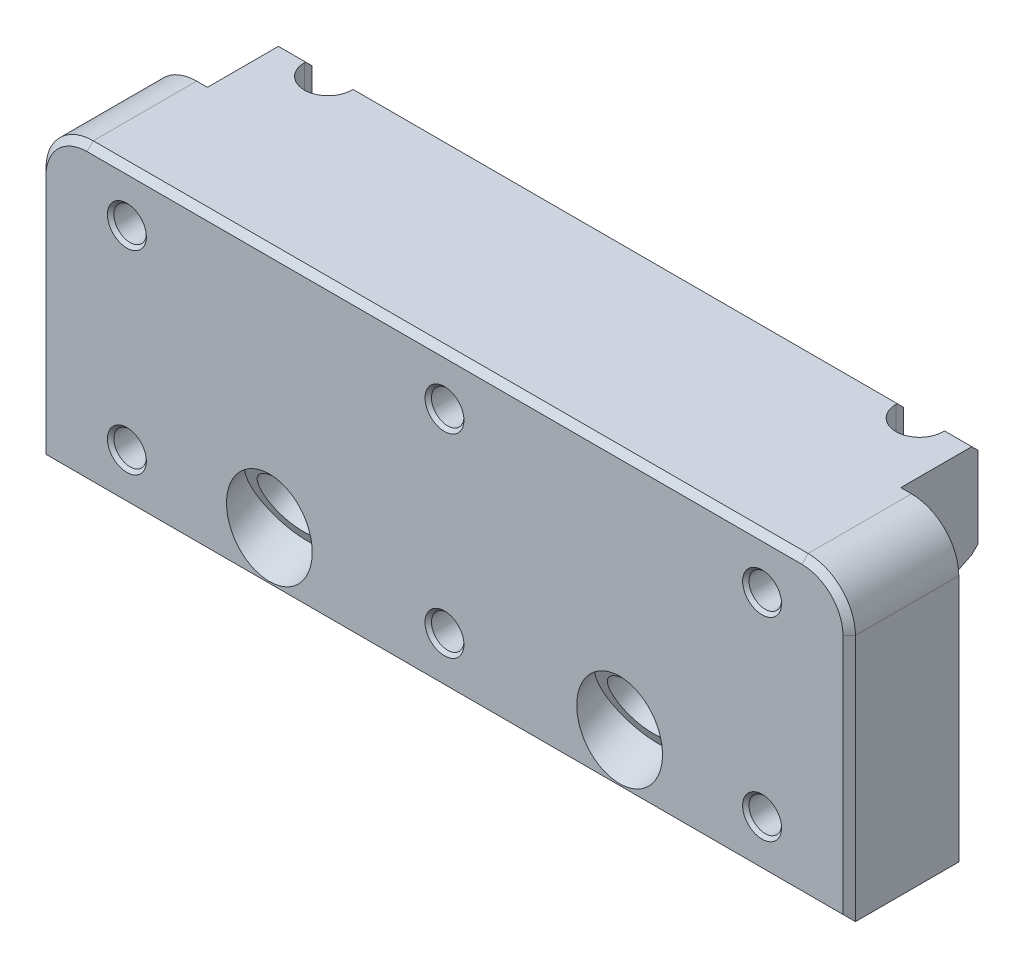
ISO-10303-21;
HEADER;
FILE_DESCRIPTION(('STEP AP214'),'2;1');
FILE_NAME('part.step','',(''),(''),'','','');
FILE_SCHEMA(('AUTOMOTIVE_DESIGN { 1 0 10303 214 1 1 1 1 }'));
ENDSEC;
DATA;
#1=APPLICATION_CONTEXT('core data for automotive mechanical design processes');
#2=APPLICATION_PROTOCOL_DEFINITION('international standard','automotive_design',2000,#1);
#3=PRODUCT_CONTEXT('',#1,'mechanical');
#4=PRODUCT('Part','Part','',(#3));
#5=PRODUCT_RELATED_PRODUCT_CATEGORY('part','',(#4));
#6=PRODUCT_DEFINITION_FORMATION('','',#4);
#7=PRODUCT_DEFINITION_CONTEXT('part definition',#1,'design');
#8=PRODUCT_DEFINITION('design','',#6,#7);
#9=PRODUCT_DEFINITION_SHAPE('','',#8);
#10=(LENGTH_UNIT() NAMED_UNIT(*) SI_UNIT(.MILLI.,.METRE.));
#11=(NAMED_UNIT(*) PLANE_ANGLE_UNIT() SI_UNIT($,.RADIAN.));
#12=(NAMED_UNIT(*) SI_UNIT($,.STERADIAN.) SOLID_ANGLE_UNIT());
#13=UNCERTAINTY_MEASURE_WITH_UNIT(LENGTH_MEASURE(1.E-05),#10,'distance_accuracy_value','');
#14=(GEOMETRIC_REPRESENTATION_CONTEXT(3) GLOBAL_UNCERTAINTY_ASSIGNED_CONTEXT((#13)) GLOBAL_UNIT_ASSIGNED_CONTEXT((#10,
#11,#12)) REPRESENTATION_CONTEXT('',''));
#15=CARTESIAN_POINT('',(0.,0.,0.));
#16=DIRECTION('',(0.,0.,1.));
#17=DIRECTION('',(1.,0.,0.));
#18=AXIS2_PLACEMENT_3D('',#15,#16,#17);
#19=CARTESIAN_POINT('',(0.,60.198,22.352));
#20=DIRECTION('',(0.,0.,-1.));
#21=DIRECTION('',(-1.,0.,0.));
#22=AXIS2_PLACEMENT_3D('',#19,#20,#21);
#23=PLANE('',#22);
#24=DIRECTION('',(0.999999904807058,-0.000436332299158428,0.));
#25=VECTOR('',#24,1.);
#26=CARTESIAN_POINT('',(68.738749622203,10.2852683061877,22.352));
#27=LINE('',#26,#25);
#28=CARTESIAN_POINT('',(68.7390036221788,10.2852681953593,22.352));
#29=VERTEX_POINT('',#28);
#30=CARTESIAN_POINT('',(68.738749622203,10.2852683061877,22.352));
#31=VERTEX_POINT('',#30);
#32=EDGE_CURVE('E527',#29,#31,#27,.F.);
#33=ORIENTED_EDGE('',*,*,#32,.F.);
#34=CARTESIAN_POINT('',(64.77,10.287,22.352));
#35=DIRECTION('',(0.,0.,1.));
#36=DIRECTION('',(1.,0.,0.));
#37=AXIS2_PLACEMENT_3D('',#34,#35,#36);
#38=CIRCLE('',#37,3.969004);
#39=CARTESIAN_POINT('',(68.739004,10.287,22.352));
#40=VERTEX_POINT('',#39);
#41=EDGE_CURVE('E478',#40,#29,#38,.T.);
#42=ORIENTED_EDGE('',*,*,#41,.F.);
#43=DIRECTION('',(1.,0.,0.));
#44=VECTOR('',#43,1.);
#45=CARTESIAN_POINT('',(68.73875,10.287,22.352));
#46=LINE('',#45,#44);
#47=CARTESIAN_POINT('',(68.73875,10.287,22.352));
#48=VERTEX_POINT('',#47);
#49=EDGE_CURVE('E41',#40,#48,#46,.F.);
#50=ORIENTED_EDGE('',*,*,#49,.T.);
#51=CARTESIAN_POINT('',(64.77,10.287,22.352));
#52=DIRECTION('',(0.,0.,-1.));
#53=DIRECTION('',(-1.,0.,0.));
#54=AXIS2_PLACEMENT_3D('',#51,#52,#53);
#55=CIRCLE('',#54,3.96875);
#56=EDGE_CURVE('E533',#48,#31,#55,.T.);
#57=ORIENTED_EDGE('',*,*,#56,.T.);
#58=EDGE_LOOP('',(#33,#42,#50,#57));
#59=FACE_BOUND('',#58,.T.);
#60=DIRECTION('',(0.999999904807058,-0.00043633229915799,0.));
#61=VECTOR('',#60,1.);
#62=CARTESIAN_POINT('',(3.96874962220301,49.9092683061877,22.352));
#63=LINE('',#62,#61);
#64=CARTESIAN_POINT('',(3.96900362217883,49.9092681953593,22.352));
#65=VERTEX_POINT('',#64);
#66=CARTESIAN_POINT('',(3.96874962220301,49.9092683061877,22.352));
#67=VERTEX_POINT('',#66);
#68=EDGE_CURVE('E1297',#65,#67,#63,.F.);
#69=ORIENTED_EDGE('',*,*,#68,.F.);
#70=CARTESIAN_POINT('',(0.,49.911,22.352));
#71=DIRECTION('',(0.,0.,1.));
#72=DIRECTION('',(1.,0.,0.));
#73=AXIS2_PLACEMENT_3D('',#70,#71,#72);
#74=CIRCLE('',#73,3.969004);
#75=CARTESIAN_POINT('',(3.969004,49.911,22.352));
#76=VERTEX_POINT('',#75);
#77=EDGE_CURVE('E1222',#76,#65,#74,.T.);
#78=ORIENTED_EDGE('',*,*,#77,.F.);
#79=DIRECTION('',(1.,0.,0.));
#80=VECTOR('',#79,1.);
#81=CARTESIAN_POINT('',(3.96875,49.911,22.352));
#82=LINE('',#81,#80);
#83=CARTESIAN_POINT('',(3.96875,49.911,22.352));
#84=VERTEX_POINT('',#83);
#85=EDGE_CURVE('E1288',#76,#84,#82,.F.);
#86=ORIENTED_EDGE('',*,*,#85,.T.);
#87=CARTESIAN_POINT('',(0.,49.911,22.352));
#88=DIRECTION('',(0.,0.,-1.));
#89=DIRECTION('',(-1.,0.,0.));
#90=AXIS2_PLACEMENT_3D('',#87,#88,#89);
#91=CIRCLE('',#90,3.96875);
#92=EDGE_CURVE('E534',#84,#67,#91,.T.);
#93=ORIENTED_EDGE('',*,*,#92,.T.);
#94=EDGE_LOOP('',(#69,#78,#86,#93));
#95=FACE_BOUND('',#94,.T.);
#96=DIRECTION('',(0.999999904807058,-0.00043633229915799,0.));
#97=VECTOR('',#96,1.);
#98=CARTESIAN_POINT('',(-60.801250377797,49.9092683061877,22.352));
#99=LINE('',#98,#97);
#100=CARTESIAN_POINT('',(-60.8009963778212,49.9092681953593,22.352));
#101=VERTEX_POINT('',#100);
#102=CARTESIAN_POINT('',(-60.801250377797,49.9092683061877,22.352));
#103=VERTEX_POINT('',#102);
#104=EDGE_CURVE('E836',#101,#103,#99,.F.);
#105=ORIENTED_EDGE('',*,*,#104,.F.);
#106=CARTESIAN_POINT('',(-64.77,49.911,22.352));
#107=DIRECTION('',(0.,0.,1.));
#108=DIRECTION('',(1.,0.,0.));
#109=AXIS2_PLACEMENT_3D('',#106,#107,#108);
#110=CIRCLE('',#109,3.969004);
#111=CARTESIAN_POINT('',(-60.800996,49.911,22.352));
#112=VERTEX_POINT('',#111);
#113=EDGE_CURVE('E2386',#112,#101,#110,.T.);
#114=ORIENTED_EDGE('',*,*,#113,.F.);
#115=DIRECTION('',(1.,0.,0.));
#116=VECTOR('',#115,1.);
#117=CARTESIAN_POINT('',(-60.80125,49.911,22.352));
#118=LINE('',#117,#116);
#119=CARTESIAN_POINT('',(-60.80125,49.911,22.352));
#120=VERTEX_POINT('',#119);
#121=EDGE_CURVE('E840',#112,#120,#118,.F.);
#122=ORIENTED_EDGE('',*,*,#121,.T.);
#123=CARTESIAN_POINT('',(-64.77,49.911,22.352));
#124=DIRECTION('',(0.,0.,-1.));
#125=DIRECTION('',(-1.,0.,0.));
#126=AXIS2_PLACEMENT_3D('',#123,#124,#125);
#127=CIRCLE('',#126,3.96875);
#128=EDGE_CURVE('E807',#120,#103,#127,.T.);
#129=ORIENTED_EDGE('',*,*,#128,.T.);
#130=EDGE_LOOP('',(#105,#114,#122,#129));
#131=FACE_BOUND('',#130,.T.);
#132=DIRECTION('',(0.,-1.,0.));
#133=VECTOR('',#132,1.);
#134=CARTESIAN_POINT('',(-81.2673,0.,22.352));
#135=LINE('',#134,#133);
#136=CARTESIAN_POINT('',(-81.2673,50.546,22.352));
#137=VERTEX_POINT('',#136);
#138=CARTESIAN_POINT('',(-81.2673,1.27,22.352));
#139=VERTEX_POINT('',#138);
#140=EDGE_CURVE('E743',#137,#139,#135,.T.);
#141=ORIENTED_EDGE('',*,*,#140,.T.);
#142=DIRECTION('',(1.,0.,0.));
#143=VECTOR('',#142,1.);
#144=CARTESIAN_POINT('',(82.5373,1.27,22.352));
#145=LINE('',#144,#143);
#146=CARTESIAN_POINT('',(81.2673,1.27,22.352));
#147=VERTEX_POINT('',#146);
#148=EDGE_CURVE('E753',#139,#147,#145,.T.);
#149=ORIENTED_EDGE('',*,*,#148,.T.);
#150=DIRECTION('',(0.,1.,0.));
#151=VECTOR('',#150,1.);
#152=CARTESIAN_POINT('',(81.2673,60.198,22.352));
#153=LINE('',#152,#151);
#154=CARTESIAN_POINT('',(81.2673,50.546,22.352));
#155=VERTEX_POINT('',#154);
#156=EDGE_CURVE('E751',#147,#155,#153,.T.);
#157=ORIENTED_EDGE('',*,*,#156,.T.);
#158=CARTESIAN_POINT('',(72.8853,50.546,22.352));
#159=DIRECTION('',(0.,0.,-1.));
#160=DIRECTION('',(-1.,0.,0.));
#161=AXIS2_PLACEMENT_3D('',#158,#159,#160);
#162=CIRCLE('',#161,8.382);
#163=CARTESIAN_POINT('',(72.8853,58.928,22.352));
#164=VERTEX_POINT('',#163);
#165=EDGE_CURVE('E749',#155,#164,#162,.F.);
#166=ORIENTED_EDGE('',*,*,#165,.T.);
#167=DIRECTION('',(-1.,0.,0.));
#168=VECTOR('',#167,1.);
#169=CARTESIAN_POINT('',(0.,58.928,22.352));
#170=LINE('',#169,#168);
#171=CARTESIAN_POINT('',(-72.8853,58.928,22.352));
#172=VERTEX_POINT('',#171);
#173=EDGE_CURVE('E747',#164,#172,#170,.T.);
#174=ORIENTED_EDGE('',*,*,#173,.T.);
#175=CARTESIAN_POINT('',(-72.8853,50.546,22.352));
#176=DIRECTION('',(0.,0.,-1.));
#177=DIRECTION('',(-1.,0.,0.));
#178=AXIS2_PLACEMENT_3D('',#175,#176,#177);
#179=CIRCLE('',#178,8.382);
#180=EDGE_CURVE('E745',#172,#137,#179,.F.);
#181=ORIENTED_EDGE('',*,*,#180,.T.);
#182=EDGE_LOOP('',(#141,#149,#157,#166,#174,#181));
#183=FACE_BOUND('',#182,.T.);
#184=CARTESIAN_POINT('',(-35.7124,11.0867451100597,22.352));
#185=DIRECTION('',(0.,0.,-1.));
#186=DIRECTION('',(0.,1.,0.));
#187=AXIS2_PLACEMENT_3D('',#184,#185,#186);
#188=ELLIPSE('',#187,9.49218243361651,8.7376);
#189=CARTESIAN_POINT('',(-35.7124,20.5789275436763,22.352));
#190=VERTEX_POINT('',#189);
#191=EDGE_CURVE('E696',#190,#190,#188,.F.);
#192=ORIENTED_EDGE('',*,*,#191,.F.);
#193=EDGE_LOOP('',(#192));
#194=FACE_BOUND('',#193,.T.);
#195=CARTESIAN_POINT('',(35.7124,11.0867451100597,22.352));
#196=DIRECTION('',(0.,0.,-1.));
#197=DIRECTION('',(0.,1.,0.));
#198=AXIS2_PLACEMENT_3D('',#195,#196,#197);
#199=ELLIPSE('',#198,9.49218243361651,8.7376);
#200=CARTESIAN_POINT('',(35.7124,20.5789275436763,22.352));
#201=VERTEX_POINT('',#200);
#202=EDGE_CURVE('E694',#201,#201,#199,.F.);
#203=ORIENTED_EDGE('',*,*,#202,.F.);
#204=EDGE_LOOP('',(#203));
#205=FACE_BOUND('',#204,.T.);
#206=DIRECTION('',(0.999999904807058,-0.00043633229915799,0.));
#207=VECTOR('',#206,1.);
#208=CARTESIAN_POINT('',(-60.801250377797,10.2852683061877,22.352));
#209=LINE('',#208,#207);
#210=CARTESIAN_POINT('',(-60.8009963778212,10.2852681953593,22.352));
#211=VERTEX_POINT('',#210);
#212=CARTESIAN_POINT('',(-60.801250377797,10.2852683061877,22.352));
#213=VERTEX_POINT('',#212);
#214=EDGE_CURVE('E1204',#211,#213,#209,.F.);
#215=ORIENTED_EDGE('',*,*,#214,.F.);
#216=CARTESIAN_POINT('',(-64.77,10.287,22.352));
#217=DIRECTION('',(0.,0.,1.));
#218=DIRECTION('',(1.,0.,0.));
#219=AXIS2_PLACEMENT_3D('',#216,#217,#218);
#220=CIRCLE('',#219,3.969004);
#221=CARTESIAN_POINT('',(-60.800996,10.287,22.352));
#222=VERTEX_POINT('',#221);
#223=EDGE_CURVE('E2364',#222,#211,#220,.T.);
#224=ORIENTED_EDGE('',*,*,#223,.F.);
#225=DIRECTION('',(1.,0.,0.));
#226=VECTOR('',#225,1.);
#227=CARTESIAN_POINT('',(-60.80125,10.287,22.352));
#228=LINE('',#227,#226);
#229=CARTESIAN_POINT('',(-60.80125,10.287,22.352));
#230=VERTEX_POINT('',#229);
#231=EDGE_CURVE('E2362',#222,#230,#228,.F.);
#232=ORIENTED_EDGE('',*,*,#231,.T.);
#233=CARTESIAN_POINT('',(-64.77,10.287,22.352));
#234=DIRECTION('',(0.,0.,-1.));
#235=DIRECTION('',(-1.,0.,0.));
#236=AXIS2_PLACEMENT_3D('',#233,#234,#235);
#237=CIRCLE('',#236,3.96875);
#238=EDGE_CURVE('E812',#230,#213,#237,.T.);
#239=ORIENTED_EDGE('',*,*,#238,.T.);
#240=EDGE_LOOP('',(#215,#224,#232,#239));
#241=FACE_BOUND('',#240,.T.);
#242=DIRECTION('',(0.999999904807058,-0.000436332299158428,0.));
#243=VECTOR('',#242,1.);
#244=CARTESIAN_POINT('',(3.96874962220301,10.2852683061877,22.352));
#245=LINE('',#244,#243);
#246=CARTESIAN_POINT('',(3.96900362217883,10.2852681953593,22.352));
#247=VERTEX_POINT('',#246);
#248=CARTESIAN_POINT('',(3.96874962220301,10.2852683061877,22.352));
#249=VERTEX_POINT('',#248);
#250=EDGE_CURVE('E1209',#247,#249,#245,.F.);
#251=ORIENTED_EDGE('',*,*,#250,.F.);
#252=CARTESIAN_POINT('',(0.,10.287,22.352));
#253=DIRECTION('',(0.,0.,1.));
#254=DIRECTION('',(1.,0.,0.));
#255=AXIS2_PLACEMENT_3D('',#252,#253,#254);
#256=CIRCLE('',#255,3.969004);
#257=CARTESIAN_POINT('',(3.969004,10.287,22.352));
#258=VERTEX_POINT('',#257);
#259=EDGE_CURVE('E1212',#258,#247,#256,.T.);
#260=ORIENTED_EDGE('',*,*,#259,.F.);
#261=DIRECTION('',(1.,0.,0.));
#262=VECTOR('',#261,1.);
#263=CARTESIAN_POINT('',(3.96875,10.287,22.352));
#264=LINE('',#263,#262);
#265=CARTESIAN_POINT('',(3.96875,10.287,22.352));
#266=VERTEX_POINT('',#265);
#267=EDGE_CURVE('E1219',#258,#266,#264,.F.);
#268=ORIENTED_EDGE('',*,*,#267,.T.);
#269=CARTESIAN_POINT('',(0.,10.287,22.352));
#270=DIRECTION('',(0.,0.,-1.));
#271=DIRECTION('',(-1.,0.,0.));
#272=AXIS2_PLACEMENT_3D('',#269,#270,#271);
#273=CIRCLE('',#272,3.96875);
#274=EDGE_CURVE('E1214',#266,#249,#273,.T.);
#275=ORIENTED_EDGE('',*,*,#274,.T.);
#276=EDGE_LOOP('',(#251,#260,#268,#275));
#277=FACE_BOUND('',#276,.T.);
#278=DIRECTION('',(0.999999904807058,-0.000436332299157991,0.));
#279=VECTOR('',#278,1.);
#280=CARTESIAN_POINT('',(68.738749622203,49.9092683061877,22.352));
#281=LINE('',#280,#279);
#282=CARTESIAN_POINT('',(68.7390036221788,49.9092681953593,22.352));
#283=VERTEX_POINT('',#282);
#284=CARTESIAN_POINT('',(68.738749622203,49.9092683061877,22.352));
#285=VERTEX_POINT('',#284);
#286=EDGE_CURVE('E500',#283,#285,#281,.F.);
#287=ORIENTED_EDGE('',*,*,#286,.F.);
#288=CARTESIAN_POINT('',(64.77,49.911,22.352));
#289=DIRECTION('',(0.,0.,1.));
#290=DIRECTION('',(1.,0.,0.));
#291=AXIS2_PLACEMENT_3D('',#288,#289,#290);
#292=CIRCLE('',#291,3.969004);
#293=CARTESIAN_POINT('',(68.739004,49.911,22.352));
#294=VERTEX_POINT('',#293);
#295=EDGE_CURVE('E562',#294,#283,#292,.T.);
#296=ORIENTED_EDGE('',*,*,#295,.F.);
#297=DIRECTION('',(1.,0.,0.));
#298=VECTOR('',#297,1.);
#299=CARTESIAN_POINT('',(68.73875,49.911,22.352));
#300=LINE('',#299,#298);
#301=CARTESIAN_POINT('',(68.73875,49.911,22.352));
#302=VERTEX_POINT('',#301);
#303=EDGE_CURVE('E20',#294,#302,#300,.F.);
#304=ORIENTED_EDGE('',*,*,#303,.T.);
#305=CARTESIAN_POINT('',(64.77,49.911,22.352));
#306=DIRECTION('',(0.,0.,-1.));
#307=DIRECTION('',(-1.,0.,0.));
#308=AXIS2_PLACEMENT_3D('',#305,#306,#307);
#309=CIRCLE('',#308,3.96875);
#310=EDGE_CURVE('E530',#302,#285,#309,.T.);
#311=ORIENTED_EDGE('',*,*,#310,.T.);
#312=EDGE_LOOP('',(#287,#296,#304,#311));
#313=FACE_BOUND('',#312,.T.);
#314=ADVANCED_FACE('F16',(#59,#95,#131,#183,#194,#205,#241,#277,#313),#23,.F.);
#315=CARTESIAN_POINT('',(70.7009,60.198,-15.748));
#316=DIRECTION('',(0.,0.,1.));
#317=DIRECTION('',(1.,0.,0.));
#318=AXIS2_PLACEMENT_3D('',#315,#316,#317);
#319=PLANE('',#318);
#320=DIRECTION('',(0.,-1.,0.));
#321=VECTOR('',#320,1.);
#322=CARTESIAN_POINT('',(55.499,60.198,-15.748));
#323=LINE('',#322,#321);
#324=CARTESIAN_POINT('',(55.499,58.928,-15.748));
#325=VERTEX_POINT('',#324);
#326=CARTESIAN_POINT('',(55.499,42.3654504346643,-15.748));
#327=VERTEX_POINT('',#326);
#328=EDGE_CURVE('E919',#325,#327,#323,.T.);
#329=ORIENTED_EDGE('',*,*,#328,.T.);
#330=DIRECTION('',(-1.,0.,0.));
#331=VECTOR('',#330,1.);
#332=CARTESIAN_POINT('',(70.7009,42.3654504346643,-15.748));
#333=LINE('',#332,#331);
#334=CARTESIAN_POINT('',(-55.499,42.3654504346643,-15.748));
#335=VERTEX_POINT('',#334);
#336=EDGE_CURVE('E779',#327,#335,#333,.T.);
#337=ORIENTED_EDGE('',*,*,#336,.T.);
#338=DIRECTION('',(0.,1.,0.));
#339=VECTOR('',#338,1.);
#340=CARTESIAN_POINT('',(-55.499,60.198,-15.748));
#341=LINE('',#340,#339);
#342=CARTESIAN_POINT('',(-55.499,58.928,-15.748));
#343=VERTEX_POINT('',#342);
#344=EDGE_CURVE('E903',#335,#343,#341,.T.);
#345=ORIENTED_EDGE('',*,*,#344,.T.);
#346=DIRECTION('',(1.,0.,0.));
#347=VECTOR('',#346,1.);
#348=CARTESIAN_POINT('',(70.7009,58.928,-15.748));
#349=LINE('',#348,#347);
#350=EDGE_CURVE('E736',#343,#325,#349,.T.);
#351=ORIENTED_EDGE('',*,*,#350,.T.);
#352=EDGE_LOOP('',(#329,#337,#345,#351));
#353=FACE_BOUND('',#352,.T.);
#354=ADVANCED_FACE('F599',(#353),#319,.F.);
#355=DIRECTION('',(0.,-1.,0.));
#356=VECTOR('',#355,1.);
#357=CARTESIAN_POINT('',(-65.151,60.198,-15.748));
#358=LINE('',#357,#356);
#359=CARTESIAN_POINT('',(-65.151,58.928,-15.748));
#360=VERTEX_POINT('',#359);
#361=CARTESIAN_POINT('',(-65.151,42.3654504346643,-15.748));
#362=VERTEX_POINT('',#361);
#363=EDGE_CURVE('E900',#360,#362,#358,.T.);
#364=ORIENTED_EDGE('',*,*,#363,.T.);
#365=DIRECTION('',(-1.,0.,0.));
#366=VECTOR('',#365,1.);
#367=CARTESIAN_POINT('',(70.7009,42.3654504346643,-15.748));
#368=LINE('',#367,#366);
#369=CARTESIAN_POINT('',(-70.7009,42.3654504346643,-15.748));
#370=VERTEX_POINT('',#369);
#371=EDGE_CURVE('E764',#362,#370,#368,.T.);
#372=ORIENTED_EDGE('',*,*,#371,.T.);
#373=DIRECTION('',(0.,-1.,0.));
#374=VECTOR('',#373,1.);
#375=CARTESIAN_POINT('',(-70.7009,60.198,-15.748));
#376=LINE('',#375,#374);
#377=CARTESIAN_POINT('',(-70.7009,58.928,-15.748));
#378=VERTEX_POINT('',#377);
#379=EDGE_CURVE('E948',#378,#370,#376,.T.);
#380=ORIENTED_EDGE('',*,*,#379,.F.);
#381=DIRECTION('',(1.,0.,0.));
#382=VECTOR('',#381,1.);
#383=CARTESIAN_POINT('',(70.7009,58.928,-15.748));
#384=LINE('',#383,#382);
#385=EDGE_CURVE('E729',#378,#360,#384,.T.);
#386=ORIENTED_EDGE('',*,*,#385,.T.);
#387=EDGE_LOOP('',(#364,#372,#380,#386));
#388=FACE_BOUND('',#387,.T.);
#389=ADVANCED_FACE('F605',(#388),#319,.F.);
#390=CARTESIAN_POINT('',(-82.5373,0.,22.352));
#391=DIRECTION('',(0.,-1.,0.));
#392=DIRECTION('',(0.,0.,-1.));
#393=AXIS2_PLACEMENT_3D('',#390,#391,#392);
#394=PLANE('',#393);
#395=DIRECTION('',(0.,0.,-1.));
#396=VECTOR('',#395,1.);
#397=CARTESIAN_POINT('',(82.5373,0.,22.352));
#398=LINE('',#397,#396);
#399=CARTESIAN_POINT('',(82.5373,0.,21.082));
#400=VERTEX_POINT('',#399);
#401=CARTESIAN_POINT('',(82.5373,0.,0.));
#402=VERTEX_POINT('',#401);
#403=EDGE_CURVE('E932',#400,#402,#398,.T.);
#404=ORIENTED_EDGE('',*,*,#403,.F.);
#405=DIRECTION('',(-1.,0.,0.));
#406=VECTOR('',#405,1.);
#407=CARTESIAN_POINT('',(-82.5373,0.,21.082));
#408=LINE('',#407,#406);
#409=CARTESIAN_POINT('',(-82.5373,0.,21.082));
#410=VERTEX_POINT('',#409);
#411=EDGE_CURVE('E740',#400,#410,#408,.T.);
#412=ORIENTED_EDGE('',*,*,#411,.T.);
#413=DIRECTION('',(0.,0.,-1.));
#414=VECTOR('',#413,1.);
#415=CARTESIAN_POINT('',(-82.5373,0.,22.352));
#416=LINE('',#415,#414);
#417=CARTESIAN_POINT('',(-82.5373,0.,0.));
#418=VERTEX_POINT('',#417);
#419=EDGE_CURVE('E928',#410,#418,#416,.T.);
#420=ORIENTED_EDGE('',*,*,#419,.T.);
#421=DIRECTION('',(-1.,0.,0.));
#422=VECTOR('',#421,1.);
#423=CARTESIAN_POINT('',(82.5373,0.,0.));
#424=LINE('',#423,#422);
#425=EDGE_CURVE('E929',#402,#418,#424,.T.);
#426=ORIENTED_EDGE('',*,*,#425,.F.);
#427=EDGE_LOOP('',(#404,#412,#420,#426));
#428=FACE_BOUND('',#427,.T.);
#429=ADVANCED_FACE('F633',(#428),#394,.T.);
#430=CARTESIAN_POINT('',(-70.7009,60.198,0.));
#431=DIRECTION('',(-1.,0.,0.));
#432=DIRECTION('',(0.,0.,1.));
#433=AXIS2_PLACEMENT_3D('',#430,#431,#432);
#434=PLANE('',#433);
#435=ORIENTED_EDGE('',*,*,#379,.T.);
#436=DIRECTION('',(0.,0.70710678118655,-0.707106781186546));
#437=VECTOR('',#436,1.);
#438=CARTESIAN_POINT('',(-70.7009,43.4077252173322,-16.7902747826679));
#439=LINE('',#438,#437);
#440=CARTESIAN_POINT('',(-70.7009,41.101071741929,-14.4836213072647));
#441=VERTEX_POINT('',#440);
#442=EDGE_CURVE('E767',#370,#441,#439,.F.);
#443=ORIENTED_EDGE('',*,*,#442,.T.);
#444=DIRECTION('',(0.,0.438371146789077,-0.898794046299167));
#445=VECTOR('',#444,1.);
#446=CARTESIAN_POINT('',(-70.7009,39.0642896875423,-10.307599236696));
#447=LINE('',#446,#445);
#448=CARTESIAN_POINT('',(-70.7009,34.7327063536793,-1.42653728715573));
#449=VERTEX_POINT('',#448);
#450=EDGE_CURVE('E926',#449,#441,#447,.T.);
#451=ORIENTED_EDGE('',*,*,#450,.F.);
#452=CARTESIAN_POINT('',(-70.7009,32.4497694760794,-2.54));
#453=DIRECTION('',(-1.,0.,0.));
#454=DIRECTION('',(0.,0.,1.));
#455=AXIS2_PLACEMENT_3D('',#452,#453,#454);
#456=CIRCLE('',#455,2.54);
#457=CARTESIAN_POINT('',(-70.7009,32.4497694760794,0.));
#458=VERTEX_POINT('',#457);
#459=EDGE_CURVE('E799',#449,#458,#456,.F.);
#460=ORIENTED_EDGE('',*,*,#459,.T.);
#461=DIRECTION('',(0.,-1.,0.));
#462=VECTOR('',#461,1.);
#463=CARTESIAN_POINT('',(-70.7009,60.198,0.));
#464=LINE('',#463,#462);
#465=CARTESIAN_POINT('',(-70.7009,60.198,0.));
#466=VERTEX_POINT('',#465);
#467=EDGE_CURVE('E946',#466,#458,#464,.T.);
#468=ORIENTED_EDGE('',*,*,#467,.F.);
#469=DIRECTION('',(0.,0.,1.));
#470=VECTOR('',#469,1.);
#471=CARTESIAN_POINT('',(-70.7009,60.198,0.));
#472=LINE('',#471,#470);
#473=CARTESIAN_POINT('',(-70.7009,60.198,-14.478));
#474=VERTEX_POINT('',#473);
#475=EDGE_CURVE('E894',#474,#466,#472,.T.);
#476=ORIENTED_EDGE('',*,*,#475,.F.);
#477=DIRECTION('',(0.,0.707106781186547,0.707106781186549));
#478=VECTOR('',#477,1.);
#479=CARTESIAN_POINT('',(-70.7009,67.437,-7.239));
#480=LINE('',#479,#478);
#481=EDGE_CURVE('E727',#474,#378,#480,.F.);
#482=ORIENTED_EDGE('',*,*,#481,.T.);
#483=EDGE_LOOP('',(#435,#443,#451,#460,#468,#476,#482));
#484=FACE_BOUND('',#483,.T.);
#485=ADVANCED_FACE('F626',(#484),#434,.T.);
#486=CARTESIAN_POINT('',(70.7009,60.198,0.));
#487=DIRECTION('',(-1.,0.,0.));
#488=DIRECTION('',(0.,0.,1.));
#489=AXIS2_PLACEMENT_3D('',#486,#487,#488);
#490=PLANE('',#489);
#491=DIRECTION('',(0.,-1.,0.));
#492=VECTOR('',#491,1.);
#493=CARTESIAN_POINT('',(70.7009,60.198,0.));
#494=LINE('',#493,#492);
#495=CARTESIAN_POINT('',(70.7009,60.198,0.));
#496=VERTEX_POINT('',#495);
#497=CARTESIAN_POINT('',(70.7009,32.4497694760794,0.));
#498=VERTEX_POINT('',#497);
#499=EDGE_CURVE('E954',#496,#498,#494,.T.);
#500=ORIENTED_EDGE('',*,*,#499,.T.);
#501=CARTESIAN_POINT('',(70.7009,32.4497694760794,-2.54));
#502=DIRECTION('',(-1.,0.,0.));
#503=DIRECTION('',(0.,0.,1.));
#504=AXIS2_PLACEMENT_3D('',#501,#502,#503);
#505=CIRCLE('',#504,2.54);
#506=CARTESIAN_POINT('',(70.7009,34.7327063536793,-1.42653728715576));
#507=VERTEX_POINT('',#506);
#508=EDGE_CURVE('E802',#498,#507,#505,.T.);
#509=ORIENTED_EDGE('',*,*,#508,.T.);
#510=DIRECTION('',(0.,0.438371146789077,-0.898794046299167));
#511=VECTOR('',#510,1.);
#512=CARTESIAN_POINT('',(70.7009,39.0642896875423,-10.307599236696));
#513=LINE('',#512,#511);
#514=CARTESIAN_POINT('',(70.7009,41.101071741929,-14.4836213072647));
#515=VERTEX_POINT('',#514);
#516=EDGE_CURVE('E924',#507,#515,#513,.T.);
#517=ORIENTED_EDGE('',*,*,#516,.T.);
#518=DIRECTION('',(0.,-0.707106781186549,0.707106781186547));
#519=VECTOR('',#518,1.);
#520=CARTESIAN_POINT('',(70.7009,42.3654504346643,-15.748));
#521=LINE('',#520,#519);
#522=CARTESIAN_POINT('',(70.7009,42.3654504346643,-15.748));
#523=VERTEX_POINT('',#522);
#524=EDGE_CURVE('E791',#515,#523,#521,.F.);
#525=ORIENTED_EDGE('',*,*,#524,.T.);
#526=DIRECTION('',(0.,-1.,0.));
#527=VECTOR('',#526,1.);
#528=CARTESIAN_POINT('',(70.7009,60.198,-15.748));
#529=LINE('',#528,#527);
#530=CARTESIAN_POINT('',(70.7009,58.928,-15.748));
#531=VERTEX_POINT('',#530);
#532=EDGE_CURVE('E951',#531,#523,#529,.T.);
#533=ORIENTED_EDGE('',*,*,#532,.F.);
#534=DIRECTION('',(0.,-0.707106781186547,-0.707106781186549));
#535=VECTOR('',#534,1.);
#536=CARTESIAN_POINT('',(70.7009,60.198,-14.478));
#537=LINE('',#536,#535);
#538=CARTESIAN_POINT('',(70.7009,60.198,-14.478));
#539=VERTEX_POINT('',#538);
#540=EDGE_CURVE('E725',#531,#539,#537,.F.);
#541=ORIENTED_EDGE('',*,*,#540,.T.);
#542=DIRECTION('',(0.,0.,-1.));
#543=VECTOR('',#542,1.);
#544=CARTESIAN_POINT('',(70.7009,60.198,0.));
#545=LINE('',#544,#543);
#546=EDGE_CURVE('E936',#496,#539,#545,.T.);
#547=ORIENTED_EDGE('',*,*,#546,.F.);
#548=EDGE_LOOP('',(#500,#509,#517,#525,#533,#541,#547));
#549=FACE_BOUND('',#548,.T.);
#550=ADVANCED_FACE('F624',(#549),#490,.F.);
#551=ORIENTED_EDGE('',*,*,#532,.T.);
#552=DIRECTION('',(-1.,0.,0.));
#553=VECTOR('',#552,1.);
#554=CARTESIAN_POINT('',(70.7009,42.3654504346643,-15.748));
#555=LINE('',#554,#553);
#556=CARTESIAN_POINT('',(65.151,42.3654504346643,-15.748));
#557=VERTEX_POINT('',#556);
#558=EDGE_CURVE('E786',#523,#557,#555,.T.);
#559=ORIENTED_EDGE('',*,*,#558,.T.);
#560=DIRECTION('',(0.,1.,0.));
#561=VECTOR('',#560,1.);
#562=CARTESIAN_POINT('',(65.151,60.198,-15.748));
#563=LINE('',#562,#561);
#564=CARTESIAN_POINT('',(65.151,58.928,-15.748));
#565=VERTEX_POINT('',#564);
#566=EDGE_CURVE('E915',#557,#565,#563,.T.);
#567=ORIENTED_EDGE('',*,*,#566,.T.);
#568=DIRECTION('',(1.,0.,0.));
#569=VECTOR('',#568,1.);
#570=CARTESIAN_POINT('',(70.7009,58.928,-15.748));
#571=LINE('',#570,#569);
#572=EDGE_CURVE('E723',#565,#531,#571,.T.);
#573=ORIENTED_EDGE('',*,*,#572,.T.);
#574=EDGE_LOOP('',(#551,#559,#567,#573));
#575=FACE_BOUND('',#574,.T.);
#576=ADVANCED_FACE('F608',(#575),#319,.F.);
#577=CARTESIAN_POINT('',(-82.5373,60.198,22.352));
#578=DIRECTION('',(-1.,0.,0.));
#579=DIRECTION('',(0.,0.,1.));
#580=AXIS2_PLACEMENT_3D('',#577,#578,#579);
#581=PLANE('',#580);
#582=ORIENTED_EDGE('',*,*,#419,.F.);
#583=DIRECTION('',(0.,1.,0.));
#584=VECTOR('',#583,1.);
#585=CARTESIAN_POINT('',(-82.5373,50.546,21.082));
#586=LINE('',#585,#584);
#587=CARTESIAN_POINT('',(-82.5373,50.546,21.082));
#588=VERTEX_POINT('',#587);
#589=EDGE_CURVE('E762',#410,#588,#586,.T.);
#590=ORIENTED_EDGE('',*,*,#589,.T.);
#591=DIRECTION('',(0.,0.,-1.));
#592=VECTOR('',#591,1.);
#593=CARTESIAN_POINT('',(-82.5373,50.546,0.));
#594=LINE('',#593,#592);
#595=CARTESIAN_POINT('',(-82.5373,50.546,0.));
#596=VERTEX_POINT('',#595);
#597=EDGE_CURVE('E972',#588,#596,#594,.T.);
#598=ORIENTED_EDGE('',*,*,#597,.T.);
#599=DIRECTION('',(0.,-1.,0.));
#600=VECTOR('',#599,1.);
#601=CARTESIAN_POINT('',(-82.5373,60.198,0.));
#602=LINE('',#601,#600);
#603=EDGE_CURVE('E942',#596,#418,#602,.T.);
#604=ORIENTED_EDGE('',*,*,#603,.T.);
#605=EDGE_LOOP('',(#582,#590,#598,#604));
#606=FACE_BOUND('',#605,.T.);
#607=ADVANCED_FACE('F622',(#606),#581,.T.);
#608=CARTESIAN_POINT('',(82.5373,60.198,0.));
#609=DIRECTION('',(0.,0.,1.));
#610=DIRECTION('',(1.,0.,0.));
#611=AXIS2_PLACEMENT_3D('',#608,#609,#610);
#612=PLANE('',#611);
#613=CARTESIAN_POINT('',(-35.7124,20.5746062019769,0.));
#614=DIRECTION('',(0.,0.,1.));
#615=DIRECTION('',(0.,-1.,0.));
#616=AXIS2_PLACEMENT_3D('',#613,#614,#615);
#617=ELLIPSE('',#616,6.90528678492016,6.35635);
#618=CARTESIAN_POINT('',(-35.7124,13.6693194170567,0.));
#619=VERTEX_POINT('',#618);
#620=EDGE_CURVE('E703',#619,#619,#617,.T.);
#621=ORIENTED_EDGE('',*,*,#620,.T.);
#622=EDGE_LOOP('',(#621));
#623=FACE_BOUND('',#622,.T.);
#624=CARTESIAN_POINT('',(35.7124,20.5746062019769,0.));
#625=DIRECTION('',(0.,0.,1.));
#626=DIRECTION('',(0.,-1.,0.));
#627=AXIS2_PLACEMENT_3D('',#624,#625,#626);
#628=ELLIPSE('',#627,6.90528678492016,6.35635);
#629=CARTESIAN_POINT('',(35.7124,13.6693194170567,0.));
#630=VERTEX_POINT('',#629);
#631=EDGE_CURVE('E689',#630,#630,#628,.T.);
#632=ORIENTED_EDGE('',*,*,#631,.T.);
#633=EDGE_LOOP('',(#632));
#634=FACE_BOUND('',#633,.T.);
#635=ORIENTED_EDGE('',*,*,#467,.T.);
#636=DIRECTION('',(-1.,0.,0.));
#637=VECTOR('',#636,1.);
#638=CARTESIAN_POINT('',(70.7009,32.4497694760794,0.));
#639=LINE('',#638,#637);
#640=EDGE_CURVE('E796',#458,#498,#639,.F.);
#641=ORIENTED_EDGE('',*,*,#640,.T.);
#642=ORIENTED_EDGE('',*,*,#499,.F.);
#643=DIRECTION('',(-1.,0.,0.));
#644=VECTOR('',#643,1.);
#645=CARTESIAN_POINT('',(82.5373,60.198,0.));
#646=LINE('',#645,#644);
#647=CARTESIAN_POINT('',(72.8853,60.198,0.));
#648=VERTEX_POINT('',#647);
#649=EDGE_CURVE('E933',#648,#496,#646,.T.);
#650=ORIENTED_EDGE('',*,*,#649,.F.);
#651=CARTESIAN_POINT('',(72.8853,50.546,0.));
#652=DIRECTION('',(0.,0.,1.));
#653=DIRECTION('',(1.,0.,0.));
#654=AXIS2_PLACEMENT_3D('',#651,#652,#653);
#655=CIRCLE('',#654,9.652);
#656=CARTESIAN_POINT('',(82.5373,50.546,0.));
#657=VERTEX_POINT('',#656);
#658=EDGE_CURVE('E962',#648,#657,#655,.F.);
#659=ORIENTED_EDGE('',*,*,#658,.T.);
#660=DIRECTION('',(0.,-1.,0.));
#661=VECTOR('',#660,1.);
#662=CARTESIAN_POINT('',(82.5373,60.198,0.));
#663=LINE('',#662,#661);
#664=EDGE_CURVE('E935',#657,#402,#663,.T.);
#665=ORIENTED_EDGE('',*,*,#664,.T.);
#666=ORIENTED_EDGE('',*,*,#425,.T.);
#667=ORIENTED_EDGE('',*,*,#603,.F.);
#668=CARTESIAN_POINT('',(-72.8853,50.546,0.));
#669=DIRECTION('',(0.,0.,1.));
#670=DIRECTION('',(1.,0.,0.));
#671=AXIS2_PLACEMENT_3D('',#668,#669,#670);
#672=CIRCLE('',#671,9.652);
#673=CARTESIAN_POINT('',(-72.8853,60.198,0.));
#674=VERTEX_POINT('',#673);
#675=EDGE_CURVE('E960',#596,#674,#672,.F.);
#676=ORIENTED_EDGE('',*,*,#675,.T.);
#677=DIRECTION('',(1.,0.,0.));
#678=VECTOR('',#677,1.);
#679=CARTESIAN_POINT('',(-82.5373,60.198,0.));
#680=LINE('',#679,#678);
#681=EDGE_CURVE('E939',#674,#466,#680,.T.);
#682=ORIENTED_EDGE('',*,*,#681,.T.);
#683=EDGE_LOOP('',(#635,#641,#642,#650,#659,#665,#666,#667,#676,#682));
#684=FACE_BOUND('',#683,.T.);
#685=ADVANCED_FACE('F618',(#623,#634,#684),#612,.F.);
#686=CARTESIAN_POINT('',(82.5373,60.198,22.352));
#687=DIRECTION('',(-1.,0.,0.));
#688=DIRECTION('',(0.,0.,1.));
#689=AXIS2_PLACEMENT_3D('',#686,#687,#688);
#690=PLANE('',#689);
#691=DIRECTION('',(0.,0.,-1.));
#692=VECTOR('',#691,1.);
#693=CARTESIAN_POINT('',(82.5373,50.546,22.352));
#694=LINE('',#693,#692);
#695=CARTESIAN_POINT('',(82.5373,50.546,21.082));
#696=VERTEX_POINT('',#695);
#697=EDGE_CURVE('E965',#657,#696,#694,.F.);
#698=ORIENTED_EDGE('',*,*,#697,.T.);
#699=DIRECTION('',(0.,-1.,0.));
#700=VECTOR('',#699,1.);
#701=CARTESIAN_POINT('',(82.5373,60.198,21.082));
#702=LINE('',#701,#700);
#703=EDGE_CURVE('E756',#696,#400,#702,.T.);
#704=ORIENTED_EDGE('',*,*,#703,.T.);
#705=ORIENTED_EDGE('',*,*,#403,.T.);
#706=ORIENTED_EDGE('',*,*,#664,.F.);
#707=EDGE_LOOP('',(#698,#704,#705,#706));
#708=FACE_BOUND('',#707,.T.);
#709=ADVANCED_FACE('F615',(#708),#690,.F.);
#710=CARTESIAN_POINT('',(-82.5373,60.198,22.352));
#711=DIRECTION('',(0.,-1.,0.));
#712=DIRECTION('',(0.,0.,-1.));
#713=AXIS2_PLACEMENT_3D('',#710,#711,#712);
#714=PLANE('',#713);
#715=ORIENTED_EDGE('',*,*,#546,.T.);
#716=DIRECTION('',(-1.,0.,0.));
#717=VECTOR('',#716,1.);
#718=CARTESIAN_POINT('',(-82.5373,60.198,-14.478));
#719=LINE('',#718,#717);
#720=CARTESIAN_POINT('',(65.151,60.198,-14.478));
#721=VERTEX_POINT('',#720);
#722=EDGE_CURVE('E717',#539,#721,#719,.T.);
#723=ORIENTED_EDGE('',*,*,#722,.T.);
#724=DIRECTION('',(0.,0.,1.));
#725=VECTOR('',#724,1.);
#726=CARTESIAN_POINT('',(65.151,60.198,22.352));
#727=LINE('',#726,#725);
#728=CARTESIAN_POINT('',(65.151,60.198,-14.224));
#729=VERTEX_POINT('',#728);
#730=EDGE_CURVE('E917',#721,#729,#727,.T.);
#731=ORIENTED_EDGE('',*,*,#730,.T.);
#732=CARTESIAN_POINT('',(60.325,60.198,-14.224));
#733=DIRECTION('',(0.,-1.,0.));
#734=DIRECTION('',(0.,0.,-1.));
#735=AXIS2_PLACEMENT_3D('',#732,#733,#734);
#736=CIRCLE('',#735,4.826);
#737=CARTESIAN_POINT('',(55.499,60.198,-14.224));
#738=VERTEX_POINT('',#737);
#739=EDGE_CURVE('E912',#729,#738,#736,.T.);
#740=ORIENTED_EDGE('',*,*,#739,.T.);
#741=DIRECTION('',(0.,0.,-1.));
#742=VECTOR('',#741,1.);
#743=CARTESIAN_POINT('',(55.499,60.198,22.352));
#744=LINE('',#743,#742);
#745=CARTESIAN_POINT('',(55.499,60.198,-14.478));
#746=VERTEX_POINT('',#745);
#747=EDGE_CURVE('E704',#738,#746,#744,.T.);
#748=ORIENTED_EDGE('',*,*,#747,.T.);
#749=DIRECTION('',(-1.,0.,0.));
#750=VECTOR('',#749,1.);
#751=CARTESIAN_POINT('',(-82.5373,60.198,-14.478));
#752=LINE('',#751,#750);
#753=CARTESIAN_POINT('',(-55.499,60.198,-14.478));
#754=VERTEX_POINT('',#753);
#755=EDGE_CURVE('E710',#746,#754,#752,.T.);
#756=ORIENTED_EDGE('',*,*,#755,.T.);
#757=DIRECTION('',(0.,0.,1.));
#758=VECTOR('',#757,1.);
#759=CARTESIAN_POINT('',(-55.499,60.198,22.352));
#760=LINE('',#759,#758);
#761=CARTESIAN_POINT('',(-55.499,60.198,-14.224));
#762=VERTEX_POINT('',#761);
#763=EDGE_CURVE('E905',#754,#762,#760,.T.);
#764=ORIENTED_EDGE('',*,*,#763,.T.);
#765=CARTESIAN_POINT('',(-60.325,60.198,-14.224));
#766=DIRECTION('',(0.,-1.,0.));
#767=DIRECTION('',(0.,0.,-1.));
#768=AXIS2_PLACEMENT_3D('',#765,#766,#767);
#769=CIRCLE('',#768,4.826);
#770=CARTESIAN_POINT('',(-65.151,60.198,-14.224));
#771=VERTEX_POINT('',#770);
#772=EDGE_CURVE('E897',#762,#771,#769,.T.);
#773=ORIENTED_EDGE('',*,*,#772,.T.);
#774=DIRECTION('',(0.,0.,1.));
#775=VECTOR('',#774,1.);
#776=CARTESIAN_POINT('',(-65.151,60.198,-17.78));
#777=LINE('',#776,#775);
#778=CARTESIAN_POINT('',(-65.151,60.198,-14.478));
#779=VERTEX_POINT('',#778);
#780=EDGE_CURVE('E890',#779,#771,#777,.T.);
#781=ORIENTED_EDGE('',*,*,#780,.F.);
#782=DIRECTION('',(-1.,0.,0.));
#783=VECTOR('',#782,1.);
#784=CARTESIAN_POINT('',(-82.5373,60.198,-14.478));
#785=LINE('',#784,#783);
#786=EDGE_CURVE('E714',#779,#474,#785,.T.);
#787=ORIENTED_EDGE('',*,*,#786,.T.);
#788=ORIENTED_EDGE('',*,*,#475,.T.);
#789=ORIENTED_EDGE('',*,*,#681,.F.);
#790=DIRECTION('',(0.,0.,-1.));
#791=VECTOR('',#790,1.);
#792=CARTESIAN_POINT('',(-72.8853,60.198,22.352));
#793=LINE('',#792,#791);
#794=CARTESIAN_POINT('',(-72.8853,60.198,21.082));
#795=VERTEX_POINT('',#794);
#796=EDGE_CURVE('E945',#674,#795,#793,.F.);
#797=ORIENTED_EDGE('',*,*,#796,.T.);
#798=DIRECTION('',(1.,0.,0.));
#799=VECTOR('',#798,1.);
#800=CARTESIAN_POINT('',(-82.5373,60.198,21.082));
#801=LINE('',#800,#799);
#802=CARTESIAN_POINT('',(72.8853,60.198,21.082));
#803=VERTEX_POINT('',#802);
#804=EDGE_CURVE('E708',#795,#803,#801,.T.);
#805=ORIENTED_EDGE('',*,*,#804,.T.);
#806=DIRECTION('',(0.,0.,-1.));
#807=VECTOR('',#806,1.);
#808=CARTESIAN_POINT('',(72.8853,60.198,22.352));
#809=LINE('',#808,#807);
#810=EDGE_CURVE('E963',#803,#648,#809,.T.);
#811=ORIENTED_EDGE('',*,*,#810,.T.);
#812=ORIENTED_EDGE('',*,*,#649,.T.);
#813=EDGE_LOOP('',(#715,#723,#731,#740,#748,#756,#764,#773,#781,#787,#788,#789,#797,#805,#811,#812));
#814=FACE_BOUND('',#813,.T.);
#815=ADVANCED_FACE('F613',(#814),#714,.F.);
#816=CARTESIAN_POINT('',(332.676846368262,34.0369376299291,0.));
#817=DIRECTION('',(0.,0.898794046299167,0.438371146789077));
#818=DIRECTION('',(0.,-0.438371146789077,0.898794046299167));
#819=AXIS2_PLACEMENT_3D('',#816,#817,#818);
#820=PLANE('',#819);
#821=ORIENTED_EDGE('',*,*,#516,.F.);
#822=DIRECTION('',(-1.,0.,0.));
#823=VECTOR('',#822,1.);
#824=CARTESIAN_POINT('',(-70.7009,34.7327063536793,-1.42653728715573));
#825=LINE('',#824,#823);
#826=EDGE_CURVE('E793',#507,#449,#825,.T.);
#827=ORIENTED_EDGE('',*,*,#826,.T.);
#828=ORIENTED_EDGE('',*,*,#450,.T.);
#829=DIRECTION('',(1.,0.,0.));
#830=VECTOR('',#829,1.);
#831=CARTESIAN_POINT('',(332.676846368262,41.101071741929,-14.4836213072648));
#832=LINE('',#831,#830);
#833=CARTESIAN_POINT('',(-65.151,41.101071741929,-14.4836213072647));
#834=VERTEX_POINT('',#833);
#835=EDGE_CURVE('E775',#441,#834,#832,.T.);
#836=ORIENTED_EDGE('',*,*,#835,.T.);
#837=DIRECTION('',(0.,-0.438371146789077,0.898794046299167));
#838=VECTOR('',#837,1.);
#839=CARTESIAN_POINT('',(-65.151,34.0369376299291,0.));
#840=LINE('',#839,#838);
#841=CARTESIAN_POINT('',(-65.151,40.97444596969,-14.224));
#842=VERTEX_POINT('',#841);
#843=EDGE_CURVE('E980',#834,#842,#840,.T.);
#844=ORIENTED_EDGE('',*,*,#843,.T.);
#845=CARTESIAN_POINT('',(-60.325,40.97444596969,-14.224));
#846=DIRECTION('',(0.,0.898794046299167,0.438371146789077));
#847=DIRECTION('',(0.,-0.438371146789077,0.898794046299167));
#848=AXIS2_PLACEMENT_3D('',#845,#846,#847);
#849=ELLIPSE('',#848,5.36941696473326,4.826);
#850=CARTESIAN_POINT('',(-55.499,40.97444596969,-14.224));
#851=VERTEX_POINT('',#850);
#852=EDGE_CURVE('E977',#842,#851,#849,.T.);
#853=ORIENTED_EDGE('',*,*,#852,.T.);
#854=DIRECTION('',(0.,0.438371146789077,-0.898794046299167));
#855=VECTOR('',#854,1.);
#856=CARTESIAN_POINT('',(-55.499,34.0369376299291,0.));
#857=LINE('',#856,#855);
#858=CARTESIAN_POINT('',(-55.499,41.101071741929,-14.4836213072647));
#859=VERTEX_POINT('',#858);
#860=EDGE_CURVE('E711',#851,#859,#857,.T.);
#861=ORIENTED_EDGE('',*,*,#860,.T.);
#862=DIRECTION('',(1.,0.,0.));
#863=VECTOR('',#862,1.);
#864=CARTESIAN_POINT('',(332.676846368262,41.101071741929,-14.4836213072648));
#865=LINE('',#864,#863);
#866=CARTESIAN_POINT('',(55.499,41.101071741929,-14.4836213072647));
#867=VERTEX_POINT('',#866);
#868=EDGE_CURVE('E773',#859,#867,#865,.T.);
#869=ORIENTED_EDGE('',*,*,#868,.T.);
#870=DIRECTION('',(0.,-0.438371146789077,0.898794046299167));
#871=VECTOR('',#870,1.);
#872=CARTESIAN_POINT('',(55.499,34.0369376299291,0.));
#873=LINE('',#872,#871);
#874=CARTESIAN_POINT('',(55.499,40.97444596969,-14.224));
#875=VERTEX_POINT('',#874);
#876=EDGE_CURVE('E975',#867,#875,#873,.T.);
#877=ORIENTED_EDGE('',*,*,#876,.T.);
#878=CARTESIAN_POINT('',(60.325,40.97444596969,-14.224));
#879=DIRECTION('',(0.,0.898794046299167,0.438371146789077));
#880=DIRECTION('',(0.,-0.438371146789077,0.898794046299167));
#881=AXIS2_PLACEMENT_3D('',#878,#879,#880);
#882=ELLIPSE('',#881,5.36941696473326,4.826);
#883=CARTESIAN_POINT('',(65.151,40.97444596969,-14.224));
#884=VERTEX_POINT('',#883);
#885=EDGE_CURVE('E968',#875,#884,#882,.T.);
#886=ORIENTED_EDGE('',*,*,#885,.T.);
#887=DIRECTION('',(0.,0.438371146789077,-0.898794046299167));
#888=VECTOR('',#887,1.);
#889=CARTESIAN_POINT('',(65.151,34.0369376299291,0.));
#890=LINE('',#889,#888);
#891=CARTESIAN_POINT('',(65.151,41.101071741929,-14.4836213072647));
#892=VERTEX_POINT('',#891);
#893=EDGE_CURVE('E971',#884,#892,#890,.T.);
#894=ORIENTED_EDGE('',*,*,#893,.T.);
#895=DIRECTION('',(1.,0.,0.));
#896=VECTOR('',#895,1.);
#897=CARTESIAN_POINT('',(332.676846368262,41.101071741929,-14.4836213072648));
#898=LINE('',#897,#896);
#899=EDGE_CURVE('E770',#892,#515,#898,.T.);
#900=ORIENTED_EDGE('',*,*,#899,.T.);
#901=EDGE_LOOP('',(#821,#827,#828,#836,#844,#853,#861,#869,#877,#886,#894,#900));
#902=FACE_BOUND('',#901,.T.);
#903=ADVANCED_FACE('F1066',(#902),#820,.F.);
#904=CARTESIAN_POINT('',(35.7124,2.4786526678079,42.6313949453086));
#905=DIRECTION('',(0.,0.390731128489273,-0.92050485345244));
#906=DIRECTION('',(0.,0.92050485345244,0.390731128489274));
#907=AXIS2_PLACEMENT_3D('',#904,#905,#906);
#908=CYLINDRICAL_SURFACE('',#907,8.7376);
#909=CARTESIAN_POINT('',(35.7124,12.9223776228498,18.0275208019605));
#910=DIRECTION('',(0.,-0.390731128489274,0.920504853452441));
#911=DIRECTION('',(0.,-0.92050485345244,-0.390731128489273));
#912=AXIS2_PLACEMENT_3D('',#909,#910,#911);
#913=CIRCLE('',#912,8.7376);
#914=CARTESIAN_POINT('',(35.7124,4.87937441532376,14.6134684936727));
#915=VERTEX_POINT('',#914);
#916=EDGE_CURVE('E691',#915,#915,#913,.T.);
#917=ORIENTED_EDGE('',*,*,#916,.F.);
#918=EDGE_LOOP('',(#917));
#919=FACE_BOUND('',#918,.T.);
#920=ORIENTED_EDGE('',*,*,#202,.T.);
#921=EDGE_LOOP('',(#920));
#922=FACE_BOUND('',#921,.T.);
#923=ADVANCED_FACE('F642',(#919,#922),#908,.F.);
#924=CARTESIAN_POINT('',(35.7124,12.9223776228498,18.0275208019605));
#925=DIRECTION('',(0.,-0.390731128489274,0.920504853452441));
#926=DIRECTION('',(0.,-0.92050485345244,-0.390731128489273));
#927=AXIS2_PLACEMENT_3D('',#924,#925,#926);
#928=PLANE('',#927);
#929=CARTESIAN_POINT('',(35.7124,12.9223776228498,18.0275208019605));
#930=DIRECTION('',(0.,-0.390731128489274,0.920504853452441));
#931=DIRECTION('',(0.,-0.92050485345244,-0.390731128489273));
#932=AXIS2_PLACEMENT_3D('',#929,#930,#931);
#933=CIRCLE('',#932,6.35635);
#934=CARTESIAN_POINT('',(35.7124,7.07132659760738,15.5438969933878));
#935=VERTEX_POINT('',#934);
#936=EDGE_CURVE('E686',#935,#935,#933,.T.);
#937=ORIENTED_EDGE('',*,*,#936,.F.);
#938=EDGE_LOOP('',(#937));
#939=FACE_BOUND('',#938,.T.);
#940=ORIENTED_EDGE('',*,*,#916,.T.);
#941=EDGE_LOOP('',(#940));
#942=FACE_BOUND('',#941,.T.);
#943=ADVANCED_FACE('F638',(#939,#942),#928,.T.);
#944=CARTESIAN_POINT('',(35.7124,22.327793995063,-4.13025161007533));
#945=DIRECTION('',(0.,-0.390731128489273,0.92050485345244));
#946=DIRECTION('',(0.,-0.92050485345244,-0.390731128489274));
#947=AXIS2_PLACEMENT_3D('',#944,#945,#946);
#948=CYLINDRICAL_SURFACE('',#947,6.35635);
#949=ORIENTED_EDGE('',*,*,#936,.T.);
#950=EDGE_LOOP('',(#949));
#951=FACE_BOUND('',#950,.T.);
#952=ORIENTED_EDGE('',*,*,#631,.F.);
#953=EDGE_LOOP('',(#952));
#954=FACE_BOUND('',#953,.T.);
#955=ADVANCED_FACE('F641',(#951,#954),#948,.F.);
#956=CARTESIAN_POINT('',(72.8853,50.546,22.352));
#957=DIRECTION('',(0.,0.,-1.));
#958=DIRECTION('',(-1.,0.,0.));
#959=AXIS2_PLACEMENT_3D('',#956,#957,#958);
#960=CYLINDRICAL_SURFACE('',#959,9.652);
#961=ORIENTED_EDGE('',*,*,#810,.F.);
#962=CARTESIAN_POINT('',(72.8853,50.546,21.082));
#963=DIRECTION('',(0.,0.,-1.));
#964=DIRECTION('',(-1.,0.,0.));
#965=AXIS2_PLACEMENT_3D('',#962,#963,#964);
#966=CIRCLE('',#965,9.652);
#967=EDGE_CURVE('E758',#803,#696,#966,.T.);
#968=ORIENTED_EDGE('',*,*,#967,.T.);
#969=ORIENTED_EDGE('',*,*,#697,.F.);
#970=ORIENTED_EDGE('',*,*,#658,.F.);
#971=EDGE_LOOP('',(#961,#968,#969,#970));
#972=FACE_BOUND('',#971,.T.);
#973=ADVANCED_FACE('F675',(#972),#960,.T.);
#974=CARTESIAN_POINT('',(-72.8853,50.546,22.352));
#975=DIRECTION('',(0.,0.,1.));
#976=DIRECTION('',(1.,0.,0.));
#977=AXIS2_PLACEMENT_3D('',#974,#975,#976);
#978=CYLINDRICAL_SURFACE('',#977,9.652);
#979=ORIENTED_EDGE('',*,*,#597,.F.);
#980=CARTESIAN_POINT('',(-72.8853,50.546,21.082));
#981=DIRECTION('',(0.,0.,-1.));
#982=DIRECTION('',(-1.,0.,0.));
#983=AXIS2_PLACEMENT_3D('',#980,#981,#982);
#984=CIRCLE('',#983,9.652);
#985=EDGE_CURVE('E760',#588,#795,#984,.T.);
#986=ORIENTED_EDGE('',*,*,#985,.T.);
#987=ORIENTED_EDGE('',*,*,#796,.F.);
#988=ORIENTED_EDGE('',*,*,#675,.F.);
#989=EDGE_LOOP('',(#979,#986,#987,#988));
#990=FACE_BOUND('',#989,.T.);
#991=ADVANCED_FACE('F680',(#990),#978,.T.);
#992=CARTESIAN_POINT('',(-35.7124,2.4786526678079,42.6313949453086));
#993=DIRECTION('',(0.,0.390731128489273,-0.92050485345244));
#994=DIRECTION('',(0.,0.92050485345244,0.390731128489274));
#995=AXIS2_PLACEMENT_3D('',#992,#993,#994);
#996=CYLINDRICAL_SURFACE('',#995,8.7376);
#997=CARTESIAN_POINT('',(-35.7124,12.9223776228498,18.0275208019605));
#998=DIRECTION('',(0.,-0.390731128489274,0.920504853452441));
#999=DIRECTION('',(0.,-0.92050485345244,-0.390731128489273));
#1000=AXIS2_PLACEMENT_3D('',#997,#998,#999);
#1001=CIRCLE('',#1000,8.7376);
#1002=CARTESIAN_POINT('',(-35.7124,4.87937441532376,14.6134684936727));
#1003=VERTEX_POINT('',#1002);
#1004=EDGE_CURVE('E707',#1003,#1003,#1001,.F.);
#1005=ORIENTED_EDGE('',*,*,#1004,.T.);
#1006=EDGE_LOOP('',(#1005));
#1007=FACE_BOUND('',#1006,.T.);
#1008=ORIENTED_EDGE('',*,*,#191,.T.);
#1009=EDGE_LOOP('',(#1008));
#1010=FACE_BOUND('',#1009,.T.);
#1011=ADVANCED_FACE('F647',(#1007,#1010),#996,.F.);
#1012=CARTESIAN_POINT('',(-35.7124,12.9223776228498,18.0275208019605));
#1013=DIRECTION('',(0.,-0.390731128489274,0.920504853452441));
#1014=DIRECTION('',(0.,-0.92050485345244,-0.390731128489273));
#1015=AXIS2_PLACEMENT_3D('',#1012,#1013,#1014);
#1016=PLANE('',#1015);
#1017=CARTESIAN_POINT('',(-35.7124,12.9223776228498,18.0275208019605));
#1018=DIRECTION('',(0.,-0.390731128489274,0.920504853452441));
#1019=DIRECTION('',(0.,-0.92050485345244,-0.390731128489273));
#1020=AXIS2_PLACEMENT_3D('',#1017,#1018,#1019);
#1021=CIRCLE('',#1020,6.35635);
#1022=CARTESIAN_POINT('',(-35.7124,7.07132659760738,15.5438969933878));
#1023=VERTEX_POINT('',#1022);
#1024=EDGE_CURVE('E700',#1023,#1023,#1021,.T.);
#1025=ORIENTED_EDGE('',*,*,#1024,.F.);
#1026=EDGE_LOOP('',(#1025));
#1027=FACE_BOUND('',#1026,.T.);
#1028=ORIENTED_EDGE('',*,*,#1004,.F.);
#1029=EDGE_LOOP('',(#1028));
#1030=FACE_BOUND('',#1029,.T.);
#1031=ADVANCED_FACE('F644',(#1027,#1030),#1016,.T.);
#1032=CARTESIAN_POINT('',(-35.7124,22.327793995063,-4.13025161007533));
#1033=DIRECTION('',(0.,-0.390731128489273,0.92050485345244));
#1034=DIRECTION('',(0.,-0.92050485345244,-0.390731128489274));
#1035=AXIS2_PLACEMENT_3D('',#1032,#1033,#1034);
#1036=CYLINDRICAL_SURFACE('',#1035,6.35635);
#1037=ORIENTED_EDGE('',*,*,#1024,.T.);
#1038=EDGE_LOOP('',(#1037));
#1039=FACE_BOUND('',#1038,.T.);
#1040=ORIENTED_EDGE('',*,*,#620,.F.);
#1041=EDGE_LOOP('',(#1040));
#1042=FACE_BOUND('',#1041,.T.);
#1043=ADVANCED_FACE('F18',(#1039,#1042),#1036,.F.);
#1044=CARTESIAN_POINT('',(55.499,254.,-14.224));
#1045=DIRECTION('',(-1.,0.,0.));
#1046=DIRECTION('',(0.,0.,1.));
#1047=AXIS2_PLACEMENT_3D('',#1044,#1045,#1046);
#1048=PLANE('',#1047);
#1049=ORIENTED_EDGE('',*,*,#876,.F.);
#1050=DIRECTION('',(0.,-0.70710678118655,0.707106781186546));
#1051=VECTOR('',#1050,1.);
#1052=CARTESIAN_POINT('',(55.499,42.3654504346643,-15.748));
#1053=LINE('',#1052,#1051);
#1054=EDGE_CURVE('E784',#867,#327,#1053,.F.);
#1055=ORIENTED_EDGE('',*,*,#1054,.T.);
#1056=ORIENTED_EDGE('',*,*,#328,.F.);
#1057=DIRECTION('',(0.,-0.707106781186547,-0.707106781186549));
#1058=VECTOR('',#1057,1.);
#1059=CARTESIAN_POINT('',(55.499,60.198,-14.478));
#1060=LINE('',#1059,#1058);
#1061=EDGE_CURVE('E738',#325,#746,#1060,.F.);
#1062=ORIENTED_EDGE('',*,*,#1061,.T.);
#1063=ORIENTED_EDGE('',*,*,#747,.F.);
#1064=DIRECTION('',(0.,-1.,0.));
#1065=VECTOR('',#1064,1.);
#1066=CARTESIAN_POINT('',(55.499,254.,-14.224));
#1067=LINE('',#1066,#1065);
#1068=EDGE_CURVE('E907',#738,#875,#1067,.T.);
#1069=ORIENTED_EDGE('',*,*,#1068,.T.);
#1070=EDGE_LOOP('',(#1049,#1055,#1056,#1062,#1063,#1069));
#1071=FACE_BOUND('',#1070,.T.);
#1072=ADVANCED_FACE('F1026',(#1071),#1048,.F.);
#1073=CARTESIAN_POINT('',(65.151,254.,-17.78));
#1074=DIRECTION('',(1.,0.,0.));
#1075=DIRECTION('',(0.,0.,-1.));
#1076=AXIS2_PLACEMENT_3D('',#1073,#1074,#1075);
#1077=PLANE('',#1076);
#1078=ORIENTED_EDGE('',*,*,#566,.F.);
#1079=DIRECTION('',(0.,0.707106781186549,-0.707106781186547));
#1080=VECTOR('',#1079,1.);
#1081=CARTESIAN_POINT('',(65.151,42.3654504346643,-15.748));
#1082=LINE('',#1081,#1080);
#1083=EDGE_CURVE('E789',#557,#892,#1082,.F.);
#1084=ORIENTED_EDGE('',*,*,#1083,.T.);
#1085=ORIENTED_EDGE('',*,*,#893,.F.);
#1086=DIRECTION('',(0.,-1.,0.));
#1087=VECTOR('',#1086,1.);
#1088=CARTESIAN_POINT('',(65.151,254.,-14.224));
#1089=LINE('',#1088,#1087);
#1090=EDGE_CURVE('E910',#729,#884,#1089,.T.);
#1091=ORIENTED_EDGE('',*,*,#1090,.F.);
#1092=ORIENTED_EDGE('',*,*,#730,.F.);
#1093=DIRECTION('',(0.,0.707106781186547,0.707106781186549));
#1094=VECTOR('',#1093,1.);
#1095=CARTESIAN_POINT('',(65.151,60.198,-14.478));
#1096=LINE('',#1095,#1094);
#1097=EDGE_CURVE('E720',#721,#565,#1096,.F.);
#1098=ORIENTED_EDGE('',*,*,#1097,.T.);
#1099=EDGE_LOOP('',(#1078,#1084,#1085,#1091,#1092,#1098));
#1100=FACE_BOUND('',#1099,.T.);
#1101=ADVANCED_FACE('F1016',(#1100),#1077,.F.);
#1102=CARTESIAN_POINT('',(60.325,254.,-14.224));
#1103=DIRECTION('',(0.,-1.,0.));
#1104=DIRECTION('',(0.,0.,-1.));
#1105=AXIS2_PLACEMENT_3D('',#1102,#1103,#1104);
#1106=CYLINDRICAL_SURFACE('',#1105,4.826);
#1107=ORIENTED_EDGE('',*,*,#1090,.T.);
#1108=ORIENTED_EDGE('',*,*,#885,.F.);
#1109=ORIENTED_EDGE('',*,*,#1068,.F.);
#1110=ORIENTED_EDGE('',*,*,#739,.F.);
#1111=EDGE_LOOP('',(#1107,#1108,#1109,#1110));
#1112=FACE_BOUND('',#1111,.T.);
#1113=ADVANCED_FACE('F1022',(#1112),#1106,.F.);
#1114=CARTESIAN_POINT('',(-55.499,254.,-14.224));
#1115=DIRECTION('',(1.,0.,0.));
#1116=DIRECTION('',(0.,0.,1.));
#1117=AXIS2_PLACEMENT_3D('',#1114,#1115,#1116);
#1118=PLANE('',#1117);
#1119=ORIENTED_EDGE('',*,*,#344,.F.);
#1120=DIRECTION('',(0.,0.70710678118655,-0.707106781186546));
#1121=VECTOR('',#1120,1.);
#1122=CARTESIAN_POINT('',(-55.499,42.3654504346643,-15.748));
#1123=LINE('',#1122,#1121);
#1124=EDGE_CURVE('E782',#335,#859,#1123,.F.);
#1125=ORIENTED_EDGE('',*,*,#1124,.T.);
#1126=ORIENTED_EDGE('',*,*,#860,.F.);
#1127=DIRECTION('',(0.,-1.,0.));
#1128=VECTOR('',#1127,1.);
#1129=CARTESIAN_POINT('',(-55.499,254.,-14.224));
#1130=LINE('',#1129,#1128);
#1131=EDGE_CURVE('E891',#762,#851,#1130,.T.);
#1132=ORIENTED_EDGE('',*,*,#1131,.F.);
#1133=ORIENTED_EDGE('',*,*,#763,.F.);
#1134=DIRECTION('',(0.,0.707106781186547,0.707106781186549));
#1135=VECTOR('',#1134,1.);
#1136=CARTESIAN_POINT('',(-55.499,60.198,-14.478));
#1137=LINE('',#1136,#1135);
#1138=EDGE_CURVE('E733',#754,#343,#1137,.F.);
#1139=ORIENTED_EDGE('',*,*,#1138,.T.);
#1140=EDGE_LOOP('',(#1119,#1125,#1126,#1132,#1133,#1139));
#1141=FACE_BOUND('',#1140,.T.);
#1142=ADVANCED_FACE('F1037',(#1141),#1118,.F.);
#1143=CARTESIAN_POINT('',(-65.151,254.,-17.78));
#1144=DIRECTION('',(-1.,0.,0.));
#1145=DIRECTION('',(0.,0.,-1.));
#1146=AXIS2_PLACEMENT_3D('',#1143,#1144,#1145);
#1147=PLANE('',#1146);
#1148=ORIENTED_EDGE('',*,*,#843,.F.);
#1149=DIRECTION('',(0.,-0.70710678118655,0.707106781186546));
#1150=VECTOR('',#1149,1.);
#1151=CARTESIAN_POINT('',(-65.151,42.3654504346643,-15.748));
#1152=LINE('',#1151,#1150);
#1153=EDGE_CURVE('E777',#834,#362,#1152,.F.);
#1154=ORIENTED_EDGE('',*,*,#1153,.T.);
#1155=ORIENTED_EDGE('',*,*,#363,.F.);
#1156=DIRECTION('',(0.,-0.707106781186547,-0.707106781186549));
#1157=VECTOR('',#1156,1.);
#1158=CARTESIAN_POINT('',(-65.151,60.198,-14.478));
#1159=LINE('',#1158,#1157);
#1160=EDGE_CURVE('E731',#360,#779,#1159,.F.);
#1161=ORIENTED_EDGE('',*,*,#1160,.T.);
#1162=ORIENTED_EDGE('',*,*,#780,.T.);
#1163=DIRECTION('',(0.,-1.,0.));
#1164=VECTOR('',#1163,1.);
#1165=CARTESIAN_POINT('',(-65.151,254.,-14.224));
#1166=LINE('',#1165,#1164);
#1167=EDGE_CURVE('E893',#771,#842,#1166,.T.);
#1168=ORIENTED_EDGE('',*,*,#1167,.T.);
#1169=EDGE_LOOP('',(#1148,#1154,#1155,#1161,#1162,#1168));
#1170=FACE_BOUND('',#1169,.T.);
#1171=ADVANCED_FACE('F1047',(#1170),#1147,.F.);
#1172=CARTESIAN_POINT('',(-60.325,254.,-14.224));
#1173=DIRECTION('',(0.,-1.,0.));
#1174=DIRECTION('',(0.,0.,-1.));
#1175=AXIS2_PLACEMENT_3D('',#1172,#1173,#1174);
#1176=CYLINDRICAL_SURFACE('',#1175,4.826);
#1177=ORIENTED_EDGE('',*,*,#1131,.T.);
#1178=ORIENTED_EDGE('',*,*,#852,.F.);
#1179=ORIENTED_EDGE('',*,*,#1167,.F.);
#1180=ORIENTED_EDGE('',*,*,#772,.F.);
#1181=EDGE_LOOP('',(#1177,#1178,#1179,#1180));
#1182=FACE_BOUND('',#1181,.T.);
#1183=ADVANCED_FACE('F653',(#1182),#1176,.F.);
#1184=CARTESIAN_POINT('',(-64.77,10.287,5.1816));
#1185=DIRECTION('',(0.,0.,1.));
#1186=DIRECTION('',(1.,0.,0.));
#1187=AXIS2_PLACEMENT_3D('',#1184,#1185,#1186);
#1188=CYLINDRICAL_SURFACE('',#1187,3.3147);
#1189=CARTESIAN_POINT('',(-64.77,10.287,21.69795));
#1190=DIRECTION('',(0.,0.,-1.));
#1191=DIRECTION('',(-1.,0.,0.));
#1192=AXIS2_PLACEMENT_3D('',#1189,#1190,#1191);
#1193=CIRCLE('',#1192,3.3147);
#1194=CARTESIAN_POINT('',(-68.0847,10.287,21.69795));
#1195=VERTEX_POINT('',#1194);
#1196=EDGE_CURVE('E804',#1195,#1195,#1193,.F.);
#1197=ORIENTED_EDGE('',*,*,#1196,.T.);
#1198=EDGE_LOOP('',(#1197));
#1199=FACE_BOUND('',#1198,.T.);
#1200=CARTESIAN_POINT('',(-64.77,10.287,5.207));
#1201=DIRECTION('',(0.,0.,-1.));
#1202=DIRECTION('',(-1.,0.,0.));
#1203=AXIS2_PLACEMENT_3D('',#1200,#1201,#1202);
#1204=CIRCLE('',#1203,3.3147);
#1205=CARTESIAN_POINT('',(-68.0847,10.287,5.207));
#1206=VERTEX_POINT('',#1205);
#1207=EDGE_CURVE('E887',#1206,#1206,#1204,.T.);
#1208=ORIENTED_EDGE('',*,*,#1207,.T.);
#1209=EDGE_LOOP('',(#1208));
#1210=FACE_BOUND('',#1209,.T.);
#1211=ADVANCED_FACE('F649',(#1199,#1210),#1188,.F.);
#1212=CARTESIAN_POINT('',(-64.77,49.911,5.1816));
#1213=DIRECTION('',(0.,0.,1.));
#1214=DIRECTION('',(1.,0.,0.));
#1215=AXIS2_PLACEMENT_3D('',#1212,#1213,#1214);
#1216=CYLINDRICAL_SURFACE('',#1215,3.3147);
#1217=CARTESIAN_POINT('',(-64.77,49.911,21.69795));
#1218=DIRECTION('',(0.,0.,-1.));
#1219=DIRECTION('',(-1.,0.,0.));
#1220=AXIS2_PLACEMENT_3D('',#1217,#1218,#1219);
#1221=CIRCLE('',#1220,3.3147);
#1222=CARTESIAN_POINT('',(-68.0847,49.911,21.69795));
#1223=VERTEX_POINT('',#1222);
#1224=EDGE_CURVE('E10',#1223,#1223,#1221,.F.);
#1225=ORIENTED_EDGE('',*,*,#1224,.T.);
#1226=EDGE_LOOP('',(#1225));
#1227=FACE_BOUND('',#1226,.T.);
#1228=CARTESIAN_POINT('',(-64.77,49.911,5.207));
#1229=DIRECTION('',(0.,0.,-1.));
#1230=DIRECTION('',(-1.,0.,0.));
#1231=AXIS2_PLACEMENT_3D('',#1228,#1229,#1230);
#1232=CIRCLE('',#1231,3.3147);
#1233=CARTESIAN_POINT('',(-68.0847,49.911,5.207));
#1234=VERTEX_POINT('',#1233);
#1235=EDGE_CURVE('E884',#1234,#1234,#1232,.T.);
#1236=ORIENTED_EDGE('',*,*,#1235,.T.);
#1237=EDGE_LOOP('',(#1236));
#1238=FACE_BOUND('',#1237,.T.);
#1239=ADVANCED_FACE('F652',(#1227,#1238),#1216,.F.);
#1240=CARTESIAN_POINT('',(0.,49.911,5.1816));
#1241=DIRECTION('',(0.,0.,1.));
#1242=DIRECTION('',(1.,0.,0.));
#1243=AXIS2_PLACEMENT_3D('',#1240,#1241,#1242);
#1244=CYLINDRICAL_SURFACE('',#1243,3.3147);
#1245=CARTESIAN_POINT('',(0.,49.911,21.69795));
#1246=DIRECTION('',(0.,0.,-1.));
#1247=DIRECTION('',(-1.,0.,0.));
#1248=AXIS2_PLACEMENT_3D('',#1245,#1246,#1247);
#1249=CIRCLE('',#1248,3.3147);
#1250=CARTESIAN_POINT('',(-3.3147,49.911,21.69795));
#1251=VERTEX_POINT('',#1250);
#1252=EDGE_CURVE('E26',#1251,#1251,#1249,.F.);
#1253=ORIENTED_EDGE('',*,*,#1252,.T.);
#1254=EDGE_LOOP('',(#1253));
#1255=FACE_BOUND('',#1254,.T.);
#1256=CARTESIAN_POINT('',(0.,49.911,5.207));
#1257=DIRECTION('',(0.,0.,-1.));
#1258=DIRECTION('',(-1.,0.,0.));
#1259=AXIS2_PLACEMENT_3D('',#1256,#1257,#1258);
#1260=CIRCLE('',#1259,3.3147);
#1261=CARTESIAN_POINT('',(-3.3147,49.911,5.207));
#1262=VERTEX_POINT('',#1261);
#1263=EDGE_CURVE('E881',#1262,#1262,#1260,.T.);
#1264=ORIENTED_EDGE('',*,*,#1263,.T.);
#1265=EDGE_LOOP('',(#1264));
#1266=FACE_BOUND('',#1265,.T.);
#1267=ADVANCED_FACE('F657',(#1255,#1266),#1244,.F.);
#1268=CARTESIAN_POINT('',(64.77,49.911,5.1816));
#1269=DIRECTION('',(0.,0.,1.));
#1270=DIRECTION('',(1.,0.,0.));
#1271=AXIS2_PLACEMENT_3D('',#1268,#1269,#1270);
#1272=CYLINDRICAL_SURFACE('',#1271,3.3147);
#1273=CARTESIAN_POINT('',(64.77,49.911,21.69795));
#1274=DIRECTION('',(0.,0.,-1.));
#1275=DIRECTION('',(-1.,0.,0.));
#1276=AXIS2_PLACEMENT_3D('',#1273,#1274,#1275);
#1277=CIRCLE('',#1276,3.3147);
#1278=CARTESIAN_POINT('',(61.4553,49.911,21.69795));
#1279=VERTEX_POINT('',#1278);
#1280=EDGE_CURVE('E815',#1279,#1279,#1277,.F.);
#1281=ORIENTED_EDGE('',*,*,#1280,.T.);
#1282=EDGE_LOOP('',(#1281));
#1283=FACE_BOUND('',#1282,.T.);
#1284=CARTESIAN_POINT('',(64.77,49.911,5.207));
#1285=DIRECTION('',(0.,0.,-1.));
#1286=DIRECTION('',(-1.,0.,0.));
#1287=AXIS2_PLACEMENT_3D('',#1284,#1285,#1286);
#1288=CIRCLE('',#1287,3.3147);
#1289=CARTESIAN_POINT('',(61.4553,49.911,5.207));
#1290=VERTEX_POINT('',#1289);
#1291=EDGE_CURVE('E878',#1290,#1290,#1288,.T.);
#1292=ORIENTED_EDGE('',*,*,#1291,.T.);
#1293=EDGE_LOOP('',(#1292));
#1294=FACE_BOUND('',#1293,.T.);
#1295=ADVANCED_FACE('F661',(#1283,#1294),#1272,.F.);
#1296=CARTESIAN_POINT('',(64.77,10.287,5.1816));
#1297=DIRECTION('',(0.,0.,1.));
#1298=DIRECTION('',(1.,0.,0.));
#1299=AXIS2_PLACEMENT_3D('',#1296,#1297,#1298);
#1300=CYLINDRICAL_SURFACE('',#1299,3.3147);
#1301=CARTESIAN_POINT('',(64.77,10.287,21.69795));
#1302=DIRECTION('',(0.,0.,-1.));
#1303=DIRECTION('',(-1.,0.,0.));
#1304=AXIS2_PLACEMENT_3D('',#1301,#1302,#1303);
#1305=CIRCLE('',#1304,3.3147);
#1306=CARTESIAN_POINT('',(61.4553,10.287,21.69795));
#1307=VERTEX_POINT('',#1306);
#1308=EDGE_CURVE('E811',#1307,#1307,#1305,.F.);
#1309=ORIENTED_EDGE('',*,*,#1308,.T.);
#1310=EDGE_LOOP('',(#1309));
#1311=FACE_BOUND('',#1310,.T.);
#1312=CARTESIAN_POINT('',(64.77,10.287,5.207));
#1313=DIRECTION('',(0.,0.,-1.));
#1314=DIRECTION('',(-1.,0.,0.));
#1315=AXIS2_PLACEMENT_3D('',#1312,#1313,#1314);
#1316=CIRCLE('',#1315,3.3147);
#1317=CARTESIAN_POINT('',(61.4553,10.287,5.207));
#1318=VERTEX_POINT('',#1317);
#1319=EDGE_CURVE('E875',#1318,#1318,#1316,.T.);
#1320=ORIENTED_EDGE('',*,*,#1319,.T.);
#1321=EDGE_LOOP('',(#1320));
#1322=FACE_BOUND('',#1321,.T.);
#1323=ADVANCED_FACE('F667',(#1311,#1322),#1300,.F.);
#1324=CARTESIAN_POINT('',(0.,10.287,5.1816));
#1325=DIRECTION('',(0.,0.,1.));
#1326=DIRECTION('',(1.,0.,0.));
#1327=AXIS2_PLACEMENT_3D('',#1324,#1325,#1326);
#1328=CYLINDRICAL_SURFACE('',#1327,3.3147);
#1329=CARTESIAN_POINT('',(0.,10.287,21.69795));
#1330=DIRECTION('',(0.,0.,-1.));
#1331=DIRECTION('',(-1.,0.,0.));
#1332=AXIS2_PLACEMENT_3D('',#1329,#1330,#1331);
#1333=CIRCLE('',#1332,3.3147);
#1334=CARTESIAN_POINT('',(-3.3147,10.287,21.69795));
#1335=VERTEX_POINT('',#1334);
#1336=EDGE_CURVE('E808',#1335,#1335,#1333,.F.);
#1337=ORIENTED_EDGE('',*,*,#1336,.T.);
#1338=EDGE_LOOP('',(#1337));
#1339=FACE_BOUND('',#1338,.T.);
#1340=CARTESIAN_POINT('',(0.,10.287,5.207));
#1341=DIRECTION('',(0.,0.,-1.));
#1342=DIRECTION('',(-1.,0.,0.));
#1343=AXIS2_PLACEMENT_3D('',#1340,#1341,#1342);
#1344=CIRCLE('',#1343,3.3147);
#1345=CARTESIAN_POINT('',(-3.3147,10.287,5.207));
#1346=VERTEX_POINT('',#1345);
#1347=EDGE_CURVE('E872',#1346,#1346,#1344,.T.);
#1348=ORIENTED_EDGE('',*,*,#1347,.T.);
#1349=EDGE_LOOP('',(#1348));
#1350=FACE_BOUND('',#1349,.T.);
#1351=ADVANCED_FACE('F663',(#1339,#1350),#1328,.F.);
#1352=CARTESIAN_POINT('',(-64.77,10.287,5.207));
#1353=DIRECTION('',(0.,0.,1.));
#1354=DIRECTION('',(1.,0.,0.));
#1355=AXIS2_PLACEMENT_3D('',#1352,#1353,#1354);
#1356=CONICAL_SURFACE('',#1355,3.3147,1.02974425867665);
#1357=ORIENTED_EDGE('',*,*,#1207,.F.);
#1358=EDGE_LOOP('',(#1357));
#1359=FACE_BOUND('',#1358,.T.);
#1360=CARTESIAN_POINT('',(-64.77,10.287,3.21532730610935));
#1361=VERTEX_POINT('',#1360);
#1362=VERTEX_LOOP('',#1361);
#1363=FACE_BOUND('',#1362,.T.);
#1364=ADVANCED_FACE('F666',(#1359,#1363),#1356,.F.);
#1365=CARTESIAN_POINT('',(-64.77,49.911,5.207));
#1366=DIRECTION('',(0.,0.,1.));
#1367=DIRECTION('',(1.,0.,0.));
#1368=AXIS2_PLACEMENT_3D('',#1365,#1366,#1367);
#1369=CONICAL_SURFACE('',#1368,3.3147,1.02974425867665);
#1370=ORIENTED_EDGE('',*,*,#1235,.F.);
#1371=EDGE_LOOP('',(#1370));
#1372=FACE_BOUND('',#1371,.T.);
#1373=CARTESIAN_POINT('',(-64.77,49.911,3.21532730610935));
#1374=VERTEX_POINT('',#1373);
#1375=VERTEX_LOOP('',#1374);
#1376=FACE_BOUND('',#1375,.T.);
#1377=ADVANCED_FACE('F1134',(#1372,#1376),#1369,.F.);
#1378=CARTESIAN_POINT('',(0.,49.911,5.207));
#1379=DIRECTION('',(0.,0.,1.));
#1380=DIRECTION('',(1.,0.,0.));
#1381=AXIS2_PLACEMENT_3D('',#1378,#1379,#1380);
#1382=CONICAL_SURFACE('',#1381,3.3147,1.02974425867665);
#1383=ORIENTED_EDGE('',*,*,#1263,.F.);
#1384=EDGE_LOOP('',(#1383));
#1385=FACE_BOUND('',#1384,.T.);
#1386=CARTESIAN_POINT('',(0.,49.911,3.21532730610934));
#1387=VERTEX_POINT('',#1386);
#1388=VERTEX_LOOP('',#1387);
#1389=FACE_BOUND('',#1388,.T.);
#1390=ADVANCED_FACE('F1130',(#1385,#1389),#1382,.F.);
#1391=CARTESIAN_POINT('',(64.77,49.911,5.207));
#1392=DIRECTION('',(0.,0.,1.));
#1393=DIRECTION('',(1.,0.,0.));
#1394=AXIS2_PLACEMENT_3D('',#1391,#1392,#1393);
#1395=CONICAL_SURFACE('',#1394,3.3147,1.02974425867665);
#1396=ORIENTED_EDGE('',*,*,#1291,.F.);
#1397=EDGE_LOOP('',(#1396));
#1398=FACE_BOUND('',#1397,.T.);
#1399=CARTESIAN_POINT('',(64.77,49.911,3.21532730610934));
#1400=VERTEX_POINT('',#1399);
#1401=VERTEX_LOOP('',#1400);
#1402=FACE_BOUND('',#1401,.T.);
#1403=ADVANCED_FACE('F1126',(#1398,#1402),#1395,.F.);
#1404=CARTESIAN_POINT('',(64.77,10.287,5.207));
#1405=DIRECTION('',(0.,0.,1.));
#1406=DIRECTION('',(1.,0.,0.));
#1407=AXIS2_PLACEMENT_3D('',#1404,#1405,#1406);
#1408=CONICAL_SURFACE('',#1407,3.3147,1.02974425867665);
#1409=ORIENTED_EDGE('',*,*,#1319,.F.);
#1410=EDGE_LOOP('',(#1409));
#1411=FACE_BOUND('',#1410,.T.);
#1412=CARTESIAN_POINT('',(64.77,10.287,3.21532730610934));
#1413=VERTEX_POINT('',#1412);
#1414=VERTEX_LOOP('',#1413);
#1415=FACE_BOUND('',#1414,.T.);
#1416=ADVANCED_FACE('F1122',(#1411,#1415),#1408,.F.);
#1417=CARTESIAN_POINT('',(0.,10.287,5.207));
#1418=DIRECTION('',(0.,0.,1.));
#1419=DIRECTION('',(1.,0.,0.));
#1420=AXIS2_PLACEMENT_3D('',#1417,#1418,#1419);
#1421=CONICAL_SURFACE('',#1420,3.3147,1.02974425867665);
#1422=ORIENTED_EDGE('',*,*,#1347,.F.);
#1423=EDGE_LOOP('',(#1422));
#1424=FACE_BOUND('',#1423,.T.);
#1425=CARTESIAN_POINT('',(0.,10.287,3.21532730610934));
#1426=VERTEX_POINT('',#1425);
#1427=VERTEX_LOOP('',#1426);
#1428=FACE_BOUND('',#1427,.T.);
#1429=ADVANCED_FACE('F1119',(#1424,#1428),#1421,.F.);
#1430=CARTESIAN_POINT('',(-82.5373,60.198,-14.478));
#1431=DIRECTION('',(0.,-0.707106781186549,0.707106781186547));
#1432=DIRECTION('',(0.,-0.707106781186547,-0.707106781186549));
#1433=AXIS2_PLACEMENT_3D('',#1430,#1431,#1432);
#1434=PLANE('',#1433);
#1435=ORIENTED_EDGE('',*,*,#540,.F.);
#1436=ORIENTED_EDGE('',*,*,#572,.F.);
#1437=ORIENTED_EDGE('',*,*,#1097,.F.);
#1438=ORIENTED_EDGE('',*,*,#722,.F.);
#1439=EDGE_LOOP('',(#1435,#1436,#1437,#1438));
#1440=FACE_BOUND('',#1439,.T.);
#1441=ADVANCED_FACE('F1012',(#1440),#1434,.F.);
#1442=CARTESIAN_POINT('',(-82.5373,60.198,-14.478));
#1443=DIRECTION('',(0.,-0.707106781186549,0.707106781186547));
#1444=DIRECTION('',(0.,-0.707106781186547,-0.707106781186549));
#1445=AXIS2_PLACEMENT_3D('',#1442,#1443,#1444);
#1446=PLANE('',#1445);
#1447=ORIENTED_EDGE('',*,*,#1160,.F.);
#1448=ORIENTED_EDGE('',*,*,#385,.F.);
#1449=ORIENTED_EDGE('',*,*,#481,.F.);
#1450=ORIENTED_EDGE('',*,*,#786,.F.);
#1451=EDGE_LOOP('',(#1447,#1448,#1449,#1450));
#1452=FACE_BOUND('',#1451,.T.);
#1453=ADVANCED_FACE('F1054',(#1452),#1446,.F.);
#1454=CARTESIAN_POINT('',(-82.5373,60.198,-14.478));
#1455=DIRECTION('',(0.,-0.707106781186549,0.707106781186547));
#1456=DIRECTION('',(0.,-0.707106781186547,-0.707106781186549));
#1457=AXIS2_PLACEMENT_3D('',#1454,#1455,#1456);
#1458=PLANE('',#1457);
#1459=ORIENTED_EDGE('',*,*,#1061,.F.);
#1460=ORIENTED_EDGE('',*,*,#350,.F.);
#1461=ORIENTED_EDGE('',*,*,#1138,.F.);
#1462=ORIENTED_EDGE('',*,*,#755,.F.);
#1463=EDGE_LOOP('',(#1459,#1460,#1461,#1462));
#1464=FACE_BOUND('',#1463,.T.);
#1465=ADVANCED_FACE('F1033',(#1464),#1458,.F.);
#1466=CARTESIAN_POINT('',(0.,58.928,22.352));
#1467=DIRECTION('',(0.,-0.707106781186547,-0.707106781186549));
#1468=DIRECTION('',(0.,0.707106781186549,-0.707106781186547));
#1469=AXIS2_PLACEMENT_3D('',#1466,#1467,#1468);
#1470=PLANE('',#1469);
#1471=DIRECTION('',(0.,0.707106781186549,-0.707106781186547));
#1472=VECTOR('',#1471,1.);
#1473=CARTESIAN_POINT('',(-72.8853,58.928,22.352));
#1474=LINE('',#1473,#1472);
#1475=EDGE_CURVE('E866',#172,#795,#1474,.T.);
#1476=ORIENTED_EDGE('',*,*,#1475,.F.);
#1477=ORIENTED_EDGE('',*,*,#173,.F.);
#1478=DIRECTION('',(0.,-0.707106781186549,0.707106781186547));
#1479=VECTOR('',#1478,1.);
#1480=CARTESIAN_POINT('',(72.8853,60.198,21.082));
#1481=LINE('',#1480,#1479);
#1482=EDGE_CURVE('E869',#803,#164,#1481,.T.);
#1483=ORIENTED_EDGE('',*,*,#1482,.F.);
#1484=ORIENTED_EDGE('',*,*,#804,.F.);
#1485=EDGE_LOOP('',(#1476,#1477,#1483,#1484));
#1486=FACE_BOUND('',#1485,.T.);
#1487=ADVANCED_FACE('F1108',(#1486),#1470,.F.);
#1488=CARTESIAN_POINT('',(72.8853,50.546,22.352));
#1489=DIRECTION('',(0.,0.,-1.));
#1490=DIRECTION('',(-1.,0.,0.));
#1491=AXIS2_PLACEMENT_3D('',#1488,#1489,#1490);
#1492=CONICAL_SURFACE('',#1491,8.382,0.785398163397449);
#1493=ORIENTED_EDGE('',*,*,#1482,.T.);
#1494=ORIENTED_EDGE('',*,*,#165,.F.);
#1495=DIRECTION('',(-0.707106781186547,0.,0.707106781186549));
#1496=VECTOR('',#1495,1.);
#1497=CARTESIAN_POINT('',(82.5373,50.546,21.082));
#1498=LINE('',#1497,#1496);
#1499=EDGE_CURVE('E863',#696,#155,#1498,.T.);
#1500=ORIENTED_EDGE('',*,*,#1499,.F.);
#1501=ORIENTED_EDGE('',*,*,#967,.F.);
#1502=EDGE_LOOP('',(#1493,#1494,#1500,#1501));
#1503=FACE_BOUND('',#1502,.T.);
#1504=ADVANCED_FACE('F1104',(#1503),#1492,.T.);
#1505=CARTESIAN_POINT('',(-72.8853,50.546,21.082));
#1506=DIRECTION('',(0.,0.,-1.));
#1507=DIRECTION('',(-1.,0.,0.));
#1508=AXIS2_PLACEMENT_3D('',#1505,#1506,#1507);
#1509=CONICAL_SURFACE('',#1508,9.652,0.785398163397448);
#1510=ORIENTED_EDGE('',*,*,#1475,.T.);
#1511=ORIENTED_EDGE('',*,*,#985,.F.);
#1512=DIRECTION('',(-0.707106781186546,0.,-0.70710678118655));
#1513=VECTOR('',#1512,1.);
#1514=CARTESIAN_POINT('',(-81.2673,50.546,22.352));
#1515=LINE('',#1514,#1513);
#1516=EDGE_CURVE('E860',#137,#588,#1515,.T.);
#1517=ORIENTED_EDGE('',*,*,#1516,.F.);
#1518=ORIENTED_EDGE('',*,*,#180,.F.);
#1519=EDGE_LOOP('',(#1510,#1511,#1517,#1518));
#1520=FACE_BOUND('',#1519,.T.);
#1521=ADVANCED_FACE('F1100',(#1520),#1509,.T.);
#1522=CARTESIAN_POINT('',(81.2673,60.198,22.352));
#1523=DIRECTION('',(-0.707106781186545,0.,-0.70710678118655));
#1524=DIRECTION('',(-0.707106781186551,0.,0.707106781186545));
#1525=AXIS2_PLACEMENT_3D('',#1522,#1523,#1524);
#1526=PLANE('',#1525);
#1527=ORIENTED_EDGE('',*,*,#1499,.T.);
#1528=ORIENTED_EDGE('',*,*,#156,.F.);
#1529=DIRECTION('',(-0.577350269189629,0.577350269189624,0.577350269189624));
#1530=VECTOR('',#1529,1.);
#1531=CARTESIAN_POINT('',(61.6246333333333,20.9126666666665,41.9946666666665));
#1532=LINE('',#1531,#1530);
#1533=EDGE_CURVE('E858',#400,#147,#1532,.T.);
#1534=ORIENTED_EDGE('',*,*,#1533,.F.);
#1535=ORIENTED_EDGE('',*,*,#703,.F.);
#1536=EDGE_LOOP('',(#1527,#1528,#1534,#1535));
#1537=FACE_BOUND('',#1536,.T.);
#1538=ADVANCED_FACE('F1096',(#1537),#1526,.F.);
#1539=CARTESIAN_POINT('',(-82.5373,60.198,21.082));
#1540=DIRECTION('',(-0.707106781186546,0.,0.70710678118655));
#1541=DIRECTION('',(0.70710678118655,0.,0.707106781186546));
#1542=AXIS2_PLACEMENT_3D('',#1539,#1540,#1541);
#1543=PLANE('',#1542);
#1544=ORIENTED_EDGE('',*,*,#1516,.T.);
#1545=ORIENTED_EDGE('',*,*,#589,.F.);
#1546=DIRECTION('',(0.577350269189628,0.577350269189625,0.577350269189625));
#1547=VECTOR('',#1546,1.);
#1548=CARTESIAN_POINT('',(-62.4713,20.066,41.148));
#1549=LINE('',#1548,#1547);
#1550=EDGE_CURVE('E839',#139,#410,#1549,.F.);
#1551=ORIENTED_EDGE('',*,*,#1550,.F.);
#1552=ORIENTED_EDGE('',*,*,#140,.F.);
#1553=EDGE_LOOP('',(#1544,#1545,#1551,#1552));
#1554=FACE_BOUND('',#1553,.T.);
#1555=ADVANCED_FACE('F1092',(#1554),#1543,.T.);
#1556=CARTESIAN_POINT('',(-82.5373,0.,21.082));
#1557=DIRECTION('',(0.,-0.707106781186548,0.707106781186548));
#1558=DIRECTION('',(0.,-0.707106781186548,-0.707106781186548));
#1559=AXIS2_PLACEMENT_3D('',#1556,#1557,#1558);
#1560=PLANE('',#1559);
#1561=ORIENTED_EDGE('',*,*,#1533,.T.);
#1562=ORIENTED_EDGE('',*,*,#148,.F.);
#1563=ORIENTED_EDGE('',*,*,#1550,.T.);
#1564=ORIENTED_EDGE('',*,*,#411,.F.);
#1565=EDGE_LOOP('',(#1561,#1562,#1563,#1564));
#1566=FACE_BOUND('',#1565,.T.);
#1567=ADVANCED_FACE('F1086',(#1566),#1560,.T.);
#1568=CARTESIAN_POINT('',(70.7009,42.3654504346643,-15.748));
#1569=DIRECTION('',(0.,0.707106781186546,0.70710678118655));
#1570=DIRECTION('',(0.,-0.70710678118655,0.707106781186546));
#1571=AXIS2_PLACEMENT_3D('',#1568,#1569,#1570);
#1572=PLANE('',#1571);
#1573=ORIENTED_EDGE('',*,*,#1153,.F.);
#1574=ORIENTED_EDGE('',*,*,#835,.F.);
#1575=ORIENTED_EDGE('',*,*,#442,.F.);
#1576=ORIENTED_EDGE('',*,*,#371,.F.);
#1577=EDGE_LOOP('',(#1573,#1574,#1575,#1576));
#1578=FACE_BOUND('',#1577,.T.);
#1579=ADVANCED_FACE('F1061',(#1578),#1572,.F.);
#1580=CARTESIAN_POINT('',(70.7009,42.3654504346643,-15.748));
#1581=DIRECTION('',(0.,0.707106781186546,0.70710678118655));
#1582=DIRECTION('',(0.,-0.70710678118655,0.707106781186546));
#1583=AXIS2_PLACEMENT_3D('',#1580,#1581,#1582);
#1584=PLANE('',#1583);
#1585=ORIENTED_EDGE('',*,*,#1054,.F.);
#1586=ORIENTED_EDGE('',*,*,#868,.F.);
#1587=ORIENTED_EDGE('',*,*,#1124,.F.);
#1588=ORIENTED_EDGE('',*,*,#336,.F.);
#1589=EDGE_LOOP('',(#1585,#1586,#1587,#1588));
#1590=FACE_BOUND('',#1589,.T.);
#1591=ADVANCED_FACE('F1077',(#1590),#1584,.F.);
#1592=CARTESIAN_POINT('',(70.7009,42.3654504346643,-15.748));
#1593=DIRECTION('',(0.,0.707106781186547,0.707106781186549));
#1594=DIRECTION('',(0.,-0.707106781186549,0.707106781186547));
#1595=AXIS2_PLACEMENT_3D('',#1592,#1593,#1594);
#1596=PLANE('',#1595);
#1597=ORIENTED_EDGE('',*,*,#524,.F.);
#1598=ORIENTED_EDGE('',*,*,#899,.F.);
#1599=ORIENTED_EDGE('',*,*,#1083,.F.);
#1600=ORIENTED_EDGE('',*,*,#558,.F.);
#1601=EDGE_LOOP('',(#1597,#1598,#1599,#1600));
#1602=FACE_BOUND('',#1601,.T.);
#1603=ADVANCED_FACE('F1074',(#1602),#1596,.F.);
#1604=CARTESIAN_POINT('',(332.676846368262,32.4497694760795,-2.54000000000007));
#1605=DIRECTION('',(1.,0.,0.));
#1606=DIRECTION('',(0.,0.,-1.));
#1607=AXIS2_PLACEMENT_3D('',#1604,#1605,#1606);
#1608=CYLINDRICAL_SURFACE('',#1607,2.54);
#1609=ORIENTED_EDGE('',*,*,#508,.F.);
#1610=ORIENTED_EDGE('',*,*,#640,.F.);
#1611=ORIENTED_EDGE('',*,*,#459,.F.);
#1612=ORIENTED_EDGE('',*,*,#826,.F.);
#1613=EDGE_LOOP('',(#1609,#1610,#1611,#1612));
#1614=FACE_BOUND('',#1613,.T.);
#1615=ADVANCED_FACE('F1069',(#1614),#1608,.F.);
#1616=CARTESIAN_POINT('',(-64.77,10.287,21.69795));
#1617=DIRECTION('',(0.,0.,1.));
#1618=DIRECTION('',(1.,0.,0.));
#1619=AXIS2_PLACEMENT_3D('',#1616,#1617,#1618);
#1620=CONICAL_SURFACE('',#1619,3.3147,0.785398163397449);
#1621=ORIENTED_EDGE('',*,*,#238,.F.);
#1622=CARTESIAN_POINT('',(-64.77,10.287,22.352));
#1623=DIRECTION('',(0.,0.,1.));
#1624=DIRECTION('',(1.,0.,0.));
#1625=AXIS2_PLACEMENT_3D('',#1622,#1623,#1624);
#1626=CIRCLE('',#1625,3.96875);
#1627=EDGE_CURVE('E2360',#230,#213,#1626,.T.);
#1628=ORIENTED_EDGE('',*,*,#1627,.T.);
#1629=EDGE_LOOP('',(#1621,#1628));
#1630=FACE_BOUND('',#1629,.T.);
#1631=ORIENTED_EDGE('',*,*,#1196,.F.);
#1632=EDGE_LOOP('',(#1631));
#1633=FACE_BOUND('',#1632,.T.);
#1634=ADVANCED_FACE('F1487',(#1630,#1633),#1620,.F.);
#1635=CARTESIAN_POINT('',(0.,10.287,21.69795));
#1636=DIRECTION('',(0.,0.,1.));
#1637=DIRECTION('',(1.,0.,0.));
#1638=AXIS2_PLACEMENT_3D('',#1635,#1636,#1637);
#1639=CONICAL_SURFACE('',#1638,3.3147,0.785398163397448);
#1640=ORIENTED_EDGE('',*,*,#274,.F.);
#1641=CARTESIAN_POINT('',(0.,10.287,22.352));
#1642=DIRECTION('',(0.,0.,1.));
#1643=DIRECTION('',(1.,0.,0.));
#1644=AXIS2_PLACEMENT_3D('',#1641,#1642,#1643);
#1645=CIRCLE('',#1644,3.96875);
#1646=EDGE_CURVE('E1236',#266,#249,#1645,.T.);
#1647=ORIENTED_EDGE('',*,*,#1646,.T.);
#1648=EDGE_LOOP('',(#1640,#1647));
#1649=FACE_BOUND('',#1648,.T.);
#1650=ORIENTED_EDGE('',*,*,#1336,.F.);
#1651=EDGE_LOOP('',(#1650));
#1652=FACE_BOUND('',#1651,.T.);
#1653=ADVANCED_FACE('F1308',(#1649,#1652),#1639,.F.);
#1654=CARTESIAN_POINT('',(64.77,10.287,21.69795));
#1655=DIRECTION('',(0.,0.,1.));
#1656=DIRECTION('',(1.,0.,0.));
#1657=AXIS2_PLACEMENT_3D('',#1654,#1655,#1656);
#1658=CONICAL_SURFACE('',#1657,3.3147,0.785398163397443);
#1659=ORIENTED_EDGE('',*,*,#56,.F.);
#1660=CARTESIAN_POINT('',(64.77,10.287,22.352));
#1661=DIRECTION('',(0.,0.,1.));
#1662=DIRECTION('',(1.,0.,0.));
#1663=AXIS2_PLACEMENT_3D('',#1660,#1661,#1662);
#1664=CIRCLE('',#1663,3.96875);
#1665=EDGE_CURVE('E2334',#48,#31,#1664,.T.);
#1666=ORIENTED_EDGE('',*,*,#1665,.T.);
#1667=EDGE_LOOP('',(#1659,#1666));
#1668=FACE_BOUND('',#1667,.T.);
#1669=ORIENTED_EDGE('',*,*,#1308,.F.);
#1670=EDGE_LOOP('',(#1669));
#1671=FACE_BOUND('',#1670,.T.);
#1672=ADVANCED_FACE('F1481',(#1668,#1671),#1658,.F.);
#1673=CARTESIAN_POINT('',(64.77,49.911,21.69795));
#1674=DIRECTION('',(0.,0.,1.));
#1675=DIRECTION('',(1.,0.,0.));
#1676=AXIS2_PLACEMENT_3D('',#1673,#1674,#1675);
#1677=CONICAL_SURFACE('',#1676,3.3147,0.785398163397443);
#1678=ORIENTED_EDGE('',*,*,#310,.F.);
#1679=CARTESIAN_POINT('',(64.77,49.911,22.352));
#1680=DIRECTION('',(0.,0.,1.));
#1681=DIRECTION('',(1.,0.,0.));
#1682=AXIS2_PLACEMENT_3D('',#1679,#1680,#1681);
#1683=CIRCLE('',#1682,3.96875);
#1684=EDGE_CURVE('E538',#302,#285,#1683,.T.);
#1685=ORIENTED_EDGE('',*,*,#1684,.T.);
#1686=EDGE_LOOP('',(#1678,#1685));
#1687=FACE_BOUND('',#1686,.T.);
#1688=ORIENTED_EDGE('',*,*,#1280,.F.);
#1689=EDGE_LOOP('',(#1688));
#1690=FACE_BOUND('',#1689,.T.);
#1691=ADVANCED_FACE('F583',(#1687,#1690),#1677,.F.);
#1692=CARTESIAN_POINT('',(0.,49.911,21.69795));
#1693=DIRECTION('',(0.,0.,1.));
#1694=DIRECTION('',(1.,0.,0.));
#1695=AXIS2_PLACEMENT_3D('',#1692,#1693,#1694);
#1696=CONICAL_SURFACE('',#1695,3.3147,0.785398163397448);
#1697=ORIENTED_EDGE('',*,*,#92,.F.);
#1698=CARTESIAN_POINT('',(0.,49.911,22.352));
#1699=DIRECTION('',(0.,0.,1.));
#1700=DIRECTION('',(1.,0.,0.));
#1701=AXIS2_PLACEMENT_3D('',#1698,#1699,#1700);
#1702=CIRCLE('',#1701,3.96875);
#1703=EDGE_CURVE('E2502',#84,#67,#1702,.T.);
#1704=ORIENTED_EDGE('',*,*,#1703,.T.);
#1705=EDGE_LOOP('',(#1697,#1704));
#1706=FACE_BOUND('',#1705,.T.);
#1707=ORIENTED_EDGE('',*,*,#1252,.F.);
#1708=EDGE_LOOP('',(#1707));
#1709=FACE_BOUND('',#1708,.T.);
#1710=ADVANCED_FACE('F1474',(#1706,#1709),#1696,.F.);
#1711=CARTESIAN_POINT('',(-64.77,49.911,21.69795));
#1712=DIRECTION('',(0.,0.,1.));
#1713=DIRECTION('',(1.,0.,0.));
#1714=AXIS2_PLACEMENT_3D('',#1711,#1712,#1713);
#1715=CONICAL_SURFACE('',#1714,3.3147,0.785398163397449);
#1716=ORIENTED_EDGE('',*,*,#128,.F.);
#1717=CARTESIAN_POINT('',(-64.77,49.911,22.352));
#1718=DIRECTION('',(0.,0.,1.));
#1719=DIRECTION('',(1.,0.,0.));
#1720=AXIS2_PLACEMENT_3D('',#1717,#1718,#1719);
#1721=CIRCLE('',#1720,3.96875);
#1722=EDGE_CURVE('E827',#120,#103,#1721,.T.);
#1723=ORIENTED_EDGE('',*,*,#1722,.T.);
#1724=EDGE_LOOP('',(#1716,#1723));
#1725=FACE_BOUND('',#1724,.T.);
#1726=ORIENTED_EDGE('',*,*,#1224,.F.);
#1727=EDGE_LOOP('',(#1726));
#1728=FACE_BOUND('',#1727,.T.);
#1729=ADVANCED_FACE('F1467',(#1725,#1728),#1715,.F.);
#1730=CARTESIAN_POINT('',(-60.80125,49.911,7.112));
#1731=DIRECTION('',(0.,-1.,0.));
#1732=DIRECTION('',(-0.5,0.,-0.866025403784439));
#1733=AXIS2_PLACEMENT_3D('',#1730,#1731,#1732);
#1734=PLANE('',#1733);
#1735=DIRECTION('',(0.5,0.,0.86602540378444));
#1736=VECTOR('',#1735,1.);
#1737=CARTESIAN_POINT('',(-60.8010300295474,49.911,7.111873));
#1738=LINE('',#1737,#1736);
#1739=CARTESIAN_POINT('',(-60.800996,49.911,7.112));
#1740=VERTEX_POINT('',#1739);
#1741=CARTESIAN_POINT('',(-61.4423800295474,49.911,6.00102221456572));
#1742=VERTEX_POINT('',#1741);
#1743=EDGE_CURVE('E2385',#1740,#1742,#1738,.F.);
#1744=ORIENTED_EDGE('',*,*,#1743,.T.);
#1745=DIRECTION('',(0.86602540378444,0.,-0.5));
#1746=VECTOR('',#1745,1.);
#1747=CARTESIAN_POINT('',(-61.4426,49.911,6.00114921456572));
#1748=LINE('',#1747,#1746);
#1749=CARTESIAN_POINT('',(-61.4426,49.911,6.00114921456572));
#1750=VERTEX_POINT('',#1749);
#1751=EDGE_CURVE('E851',#1742,#1750,#1748,.F.);
#1752=ORIENTED_EDGE('',*,*,#1751,.T.);
#1753=DIRECTION('',(-0.5,0.,-0.866025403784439));
#1754=VECTOR('',#1753,1.);
#1755=CARTESIAN_POINT('',(-60.80125,49.911,7.112));
#1756=LINE('',#1755,#1754);
#1757=CARTESIAN_POINT('',(-60.80125,49.911,7.112));
#1758=VERTEX_POINT('',#1757);
#1759=EDGE_CURVE('E2412',#1758,#1750,#1756,.T.);
#1760=ORIENTED_EDGE('',*,*,#1759,.F.);
#1761=DIRECTION('',(0.,0.,-1.));
#1762=VECTOR('',#1761,1.);
#1763=CARTESIAN_POINT('',(-60.80125,49.911,22.352));
#1764=LINE('',#1763,#1762);
#1765=EDGE_CURVE('E833',#120,#1758,#1764,.T.);
#1766=ORIENTED_EDGE('',*,*,#1765,.F.);
#1767=ORIENTED_EDGE('',*,*,#121,.F.);
#1768=DIRECTION('',(0.,0.,1.));
#1769=VECTOR('',#1768,1.);
#1770=CARTESIAN_POINT('',(-60.800996,49.911,22.352));
#1771=LINE('',#1770,#1769);
#1772=EDGE_CURVE('E2389',#112,#1740,#1771,.F.);
#1773=ORIENTED_EDGE('',*,*,#1772,.T.);
#1774=EDGE_LOOP('',(#1744,#1752,#1760,#1766,#1767,#1773));
#1775=FACE_BOUND('',#1774,.T.);
#1776=ADVANCED_FACE('F1463',(#1775),#1734,.F.);
#1777=CARTESIAN_POINT('',(-64.77,49.911,6.00114921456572));
#1778=DIRECTION('',(0.,0.,-1.));
#1779=DIRECTION('',(-1.,0.,0.));
#1780=AXIS2_PLACEMENT_3D('',#1777,#1778,#1779);
#1781=CONICAL_SURFACE('',#1780,3.3274,1.0471975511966);
#1782=ORIENTED_EDGE('',*,*,#1751,.F.);
#1783=CARTESIAN_POINT('',(-64.77,49.911,6.00102221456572));
#1784=DIRECTION('',(0.,0.,1.));
#1785=DIRECTION('',(1.,0.,0.));
#1786=AXIS2_PLACEMENT_3D('',#1783,#1784,#1785);
#1787=CIRCLE('',#1786,3.32761997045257);
#1788=CARTESIAN_POINT('',(-61.4423803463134,49.9095480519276,6.00102221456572));
#1789=VERTEX_POINT('',#1788);
#1790=EDGE_CURVE('E828',#1742,#1789,#1787,.T.);
#1791=ORIENTED_EDGE('',*,*,#1790,.T.);
#1792=DIRECTION('',(0.866025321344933,-0.000377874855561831,-0.5));
#1793=VECTOR('',#1792,1.);
#1794=CARTESIAN_POINT('',(-61.442600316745,49.9095481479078,6.00114921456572));
#1795=LINE('',#1794,#1793);
#1796=CARTESIAN_POINT('',(-61.442600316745,49.9095481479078,6.00114921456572));
#1797=VERTEX_POINT('',#1796);
#1798=EDGE_CURVE('E2418',#1789,#1797,#1795,.F.);
#1799=ORIENTED_EDGE('',*,*,#1798,.T.);
#1800=CARTESIAN_POINT('',(-64.77,49.911,6.00114921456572));
#1801=DIRECTION('',(0.,0.,1.));
#1802=DIRECTION('',(1.,0.,0.));
#1803=AXIS2_PLACEMENT_3D('',#1800,#1801,#1802);
#1804=CIRCLE('',#1803,3.3274);
#1805=EDGE_CURVE('E2415',#1750,#1797,#1804,.T.);
#1806=ORIENTED_EDGE('',*,*,#1805,.F.);
#1807=EDGE_LOOP('',(#1782,#1791,#1799,#1806));
#1808=FACE_BOUND('',#1807,.T.);
#1809=ADVANCED_FACE('F1460',(#1808),#1781,.T.);
#1810=CARTESIAN_POINT('',(-60.801250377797,49.9092683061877,14.732));
#1811=DIRECTION('',(-0.00043633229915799,-0.999999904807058,0.));
#1812=DIRECTION('',(0.,0.,-1.));
#1813=AXIS2_PLACEMENT_3D('',#1810,#1811,#1812);
#1814=PLANE('',#1813);
#1815=DIRECTION('',(0.,0.,1.));
#1816=VECTOR('',#1815,1.);
#1817=CARTESIAN_POINT('',(-60.8009963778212,49.9092681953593,22.352));
#1818=LINE('',#1817,#1816);
#1819=CARTESIAN_POINT('',(-60.8009963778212,49.9092681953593,7.112));
#1820=VERTEX_POINT('',#1819);
#1821=EDGE_CURVE('E2369',#101,#1820,#1818,.F.);
#1822=ORIENTED_EDGE('',*,*,#1821,.F.);
#1823=ORIENTED_EDGE('',*,*,#104,.T.);
#1824=DIRECTION('',(0.,0.,-1.));
#1825=VECTOR('',#1824,1.);
#1826=CARTESIAN_POINT('',(-60.801250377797,49.9092683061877,22.352));
#1827=LINE('',#1826,#1825);
#1828=CARTESIAN_POINT('',(-60.801250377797,49.9092683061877,7.112));
#1829=VERTEX_POINT('',#1828);
#1830=EDGE_CURVE('E824',#103,#1829,#1827,.T.);
#1831=ORIENTED_EDGE('',*,*,#1830,.T.);
#1832=DIRECTION('',(-0.499999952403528,0.000218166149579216,-0.866025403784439));
#1833=VECTOR('',#1832,1.);
#1834=CARTESIAN_POINT('',(-60.801250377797,49.9092683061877,7.112));
#1835=LINE('',#1834,#1833);
#1836=EDGE_CURVE('E2410',#1829,#1797,#1835,.T.);
#1837=ORIENTED_EDGE('',*,*,#1836,.T.);
#1838=ORIENTED_EDGE('',*,*,#1798,.F.);
#1839=DIRECTION('',(0.499999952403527,-0.000218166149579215,0.86602540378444));
#1840=VECTOR('',#1839,1.);
#1841=CARTESIAN_POINT('',(-60.8010304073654,49.9092682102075,7.111873));
#1842=LINE('',#1841,#1840);
#1843=EDGE_CURVE('E2392',#1820,#1789,#1842,.F.);
#1844=ORIENTED_EDGE('',*,*,#1843,.F.);
#1845=EDGE_LOOP('',(#1822,#1823,#1831,#1837,#1838,#1844));
#1846=FACE_BOUND('',#1845,.T.);
#1847=ADVANCED_FACE('F1458',(#1846),#1814,.T.);
#1848=CARTESIAN_POINT('',(-64.77,49.911,7.112));
#1849=DIRECTION('',(0.,0.,1.));
#1850=DIRECTION('',(1.,0.,0.));
#1851=AXIS2_PLACEMENT_3D('',#1848,#1849,#1850);
#1852=CONICAL_SURFACE('',#1851,3.96875,0.523598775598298);
#1853=ORIENTED_EDGE('',*,*,#1836,.F.);
#1854=CARTESIAN_POINT('',(-64.77,49.911,7.112));
#1855=DIRECTION('',(0.,0.,1.));
#1856=DIRECTION('',(1.,0.,0.));
#1857=AXIS2_PLACEMENT_3D('',#1854,#1855,#1856);
#1858=CIRCLE('',#1857,3.96875);
#1859=EDGE_CURVE('E845',#1758,#1829,#1858,.T.);
#1860=ORIENTED_EDGE('',*,*,#1859,.F.);
#1861=ORIENTED_EDGE('',*,*,#1759,.T.);
#1862=ORIENTED_EDGE('',*,*,#1805,.T.);
#1863=EDGE_LOOP('',(#1853,#1860,#1861,#1862));
#1864=FACE_BOUND('',#1863,.T.);
#1865=ADVANCED_FACE('F1454',(#1864),#1852,.T.);
#1866=CARTESIAN_POINT('',(-64.77,49.911,22.352));
#1867=DIRECTION('',(0.,0.,1.));
#1868=DIRECTION('',(1.,0.,0.));
#1869=AXIS2_PLACEMENT_3D('',#1866,#1867,#1868);
#1870=CYLINDRICAL_SURFACE('',#1869,3.96875);
#1871=ORIENTED_EDGE('',*,*,#1830,.F.);
#1872=ORIENTED_EDGE('',*,*,#1722,.F.);
#1873=ORIENTED_EDGE('',*,*,#1765,.T.);
#1874=ORIENTED_EDGE('',*,*,#1859,.T.);
#1875=EDGE_LOOP('',(#1871,#1872,#1873,#1874));
#1876=FACE_BOUND('',#1875,.T.);
#1877=ADVANCED_FACE('F1447',(#1876),#1870,.T.);
#1878=CARTESIAN_POINT('',(-64.77,49.911,7.111873));
#1879=DIRECTION('',(0.,0.,1.));
#1880=DIRECTION('',(1.,0.,0.));
#1881=AXIS2_PLACEMENT_3D('',#1878,#1879,#1880);
#1882=CONICAL_SURFACE('',#1881,3.96896997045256,0.523598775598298);
#1883=ORIENTED_EDGE('',*,*,#1843,.T.);
#1884=ORIENTED_EDGE('',*,*,#1790,.F.);
#1885=ORIENTED_EDGE('',*,*,#1743,.F.);
#1886=CARTESIAN_POINT('',(-64.77,49.911,7.11193194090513));
#1887=DIRECTION('',(0.,0.,1.));
#1888=DIRECTION('',(1.,0.,0.));
#1889=AXIS2_PLACEMENT_3D('',#1886,#1887,#1888);
#1890=CIRCLE('',#1889,3.969004);
#1891=EDGE_CURVE('E2390',#1740,#1820,#1890,.T.);
#1892=ORIENTED_EDGE('',*,*,#1891,.T.);
#1893=EDGE_LOOP('',(#1883,#1884,#1885,#1892));
#1894=FACE_BOUND('',#1893,.T.);
#1895=ADVANCED_FACE('F1444',(#1894),#1882,.F.);
#1896=CARTESIAN_POINT('',(-64.77,49.911,22.352));
#1897=DIRECTION('',(0.,0.,1.));
#1898=DIRECTION('',(1.,0.,0.));
#1899=AXIS2_PLACEMENT_3D('',#1896,#1897,#1898);
#1900=CYLINDRICAL_SURFACE('',#1899,3.969004);
#1901=ORIENTED_EDGE('',*,*,#1821,.T.);
#1902=ORIENTED_EDGE('',*,*,#1891,.F.);
#1903=ORIENTED_EDGE('',*,*,#1772,.F.);
#1904=ORIENTED_EDGE('',*,*,#113,.T.);
#1905=EDGE_LOOP('',(#1901,#1902,#1903,#1904));
#1906=FACE_BOUND('',#1905,.T.);
#1907=ADVANCED_FACE('F1439',(#1906),#1900,.F.);
#1908=CARTESIAN_POINT('',(-60.80125,10.287,7.112));
#1909=DIRECTION('',(0.,-1.,0.));
#1910=DIRECTION('',(-0.5,0.,-0.866025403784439));
#1911=AXIS2_PLACEMENT_3D('',#1908,#1909,#1910);
#1912=PLANE('',#1911);
#1913=DIRECTION('',(0.5,0.,0.86602540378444));
#1914=VECTOR('',#1913,1.);
#1915=CARTESIAN_POINT('',(-60.8010300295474,10.287,7.111873));
#1916=LINE('',#1915,#1914);
#1917=CARTESIAN_POINT('',(-60.800996,10.287,7.112));
#1918=VERTEX_POINT('',#1917);
#1919=CARTESIAN_POINT('',(-61.4423800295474,10.287,6.00102221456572));
#1920=VERTEX_POINT('',#1919);
#1921=EDGE_CURVE('E2463',#1918,#1920,#1916,.F.);
#1922=ORIENTED_EDGE('',*,*,#1921,.T.);
#1923=DIRECTION('',(0.86602540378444,0.,-0.5));
#1924=VECTOR('',#1923,1.);
#1925=CARTESIAN_POINT('',(-61.4426,10.287,6.00114921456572));
#1926=LINE('',#1925,#1924);
#1927=CARTESIAN_POINT('',(-61.4426,10.287,6.00114921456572));
#1928=VERTEX_POINT('',#1927);
#1929=EDGE_CURVE('E2367',#1920,#1928,#1926,.F.);
#1930=ORIENTED_EDGE('',*,*,#1929,.T.);
#1931=DIRECTION('',(-0.5,0.,-0.866025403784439));
#1932=VECTOR('',#1931,1.);
#1933=CARTESIAN_POINT('',(-60.80125,10.287,7.112));
#1934=LINE('',#1933,#1932);
#1935=CARTESIAN_POINT('',(-60.80125,10.287,7.112));
#1936=VERTEX_POINT('',#1935);
#1937=EDGE_CURVE('E2447',#1936,#1928,#1934,.T.);
#1938=ORIENTED_EDGE('',*,*,#1937,.F.);
#1939=DIRECTION('',(0.,0.,-1.));
#1940=VECTOR('',#1939,1.);
#1941=CARTESIAN_POINT('',(-60.80125,10.287,22.352));
#1942=LINE('',#1941,#1940);
#1943=EDGE_CURVE('E2444',#230,#1936,#1942,.T.);
#1944=ORIENTED_EDGE('',*,*,#1943,.F.);
#1945=ORIENTED_EDGE('',*,*,#231,.F.);
#1946=DIRECTION('',(0.,0.,1.));
#1947=VECTOR('',#1946,1.);
#1948=CARTESIAN_POINT('',(-60.800996,10.287,22.352));
#1949=LINE('',#1948,#1947);
#1950=EDGE_CURVE('E2458',#222,#1918,#1949,.F.);
#1951=ORIENTED_EDGE('',*,*,#1950,.T.);
#1952=EDGE_LOOP('',(#1922,#1930,#1938,#1944,#1945,#1951));
#1953=FACE_BOUND('',#1952,.T.);
#1954=ADVANCED_FACE('F1435',(#1953),#1912,.F.);
#1955=CARTESIAN_POINT('',(-64.77,10.287,6.00114921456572));
#1956=DIRECTION('',(0.,0.,-1.));
#1957=DIRECTION('',(-1.,0.,0.));
#1958=AXIS2_PLACEMENT_3D('',#1955,#1956,#1957);
#1959=CONICAL_SURFACE('',#1958,3.3274,1.0471975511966);
#1960=ORIENTED_EDGE('',*,*,#1929,.F.);
#1961=CARTESIAN_POINT('',(-64.77,10.287,6.00102221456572));
#1962=DIRECTION('',(0.,0.,1.));
#1963=DIRECTION('',(1.,0.,0.));
#1964=AXIS2_PLACEMENT_3D('',#1961,#1962,#1963);
#1965=CIRCLE('',#1964,3.32761997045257);
#1966=CARTESIAN_POINT('',(-61.4423803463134,10.2855480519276,6.00102221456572));
#1967=VERTEX_POINT('',#1966);
#1968=EDGE_CURVE('E1291',#1920,#1967,#1965,.T.);
#1969=ORIENTED_EDGE('',*,*,#1968,.T.);
#1970=DIRECTION('',(0.866025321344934,-0.000377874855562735,-0.5));
#1971=VECTOR('',#1970,1.);
#1972=CARTESIAN_POINT('',(-61.442600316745,10.2855481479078,6.00114921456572));
#1973=LINE('',#1972,#1971);
#1974=CARTESIAN_POINT('',(-61.442600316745,10.2855481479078,6.00114921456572));
#1975=VERTEX_POINT('',#1974);
#1976=EDGE_CURVE('E2372',#1967,#1975,#1973,.F.);
#1977=ORIENTED_EDGE('',*,*,#1976,.T.);
#1978=CARTESIAN_POINT('',(-64.77,10.287,6.00114921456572));
#1979=DIRECTION('',(0.,0.,1.));
#1980=DIRECTION('',(1.,0.,0.));
#1981=AXIS2_PLACEMENT_3D('',#1978,#1979,#1980);
#1982=CIRCLE('',#1981,3.3274);
#1983=EDGE_CURVE('E2440',#1928,#1975,#1982,.T.);
#1984=ORIENTED_EDGE('',*,*,#1983,.F.);
#1985=EDGE_LOOP('',(#1960,#1969,#1977,#1984));
#1986=FACE_BOUND('',#1985,.T.);
#1987=ADVANCED_FACE('F1432',(#1986),#1959,.T.);
#1988=CARTESIAN_POINT('',(-60.801250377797,10.2852683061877,14.732));
#1989=DIRECTION('',(-0.00043633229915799,-0.999999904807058,0.));
#1990=DIRECTION('',(0.,0.,-1.));
#1991=AXIS2_PLACEMENT_3D('',#1988,#1989,#1990);
#1992=PLANE('',#1991);
#1993=DIRECTION('',(0.,0.,1.));
#1994=VECTOR('',#1993,1.);
#1995=CARTESIAN_POINT('',(-60.8009963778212,10.2852681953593,22.352));
#1996=LINE('',#1995,#1994);
#1997=CARTESIAN_POINT('',(-60.8009963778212,10.2852681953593,7.112));
#1998=VERTEX_POINT('',#1997);
#1999=EDGE_CURVE('E2453',#211,#1998,#1996,.F.);
#2000=ORIENTED_EDGE('',*,*,#1999,.F.);
#2001=ORIENTED_EDGE('',*,*,#214,.T.);
#2002=DIRECTION('',(0.,0.,-1.));
#2003=VECTOR('',#2002,1.);
#2004=CARTESIAN_POINT('',(-60.801250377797,10.2852683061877,22.352));
#2005=LINE('',#2004,#2003);
#2006=CARTESIAN_POINT('',(-60.801250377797,10.2852683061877,7.112));
#2007=VERTEX_POINT('',#2006);
#2008=EDGE_CURVE('E2481',#213,#2007,#2005,.T.);
#2009=ORIENTED_EDGE('',*,*,#2008,.T.);
#2010=DIRECTION('',(-0.499999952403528,0.000218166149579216,-0.866025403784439));
#2011=VECTOR('',#2010,1.);
#2012=CARTESIAN_POINT('',(-60.801250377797,10.2852683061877,7.112));
#2013=LINE('',#2012,#2011);
#2014=EDGE_CURVE('E2443',#2007,#1975,#2013,.T.);
#2015=ORIENTED_EDGE('',*,*,#2014,.T.);
#2016=ORIENTED_EDGE('',*,*,#1976,.F.);
#2017=DIRECTION('',(0.499999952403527,-0.000218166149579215,0.86602540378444));
#2018=VECTOR('',#2017,1.);
#2019=CARTESIAN_POINT('',(-60.8010304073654,10.2852682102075,7.111873));
#2020=LINE('',#2019,#2018);
#2021=EDGE_CURVE('E2466',#1998,#1967,#2020,.F.);
#2022=ORIENTED_EDGE('',*,*,#2021,.F.);
#2023=EDGE_LOOP('',(#2000,#2001,#2009,#2015,#2016,#2022));
#2024=FACE_BOUND('',#2023,.T.);
#2025=ADVANCED_FACE('F1430',(#2024),#1992,.T.);
#2026=CARTESIAN_POINT('',(-64.77,10.287,7.112));
#2027=DIRECTION('',(0.,0.,1.));
#2028=DIRECTION('',(1.,0.,0.));
#2029=AXIS2_PLACEMENT_3D('',#2026,#2027,#2028);
#2030=CONICAL_SURFACE('',#2029,3.96875,0.523598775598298);
#2031=ORIENTED_EDGE('',*,*,#2014,.F.);
#2032=CARTESIAN_POINT('',(-64.77,10.287,7.112));
#2033=DIRECTION('',(0.,0.,1.));
#2034=DIRECTION('',(1.,0.,0.));
#2035=AXIS2_PLACEMENT_3D('',#2032,#2033,#2034);
#2036=CIRCLE('',#2035,3.96875);
#2037=EDGE_CURVE('E2441',#1936,#2007,#2036,.T.);
#2038=ORIENTED_EDGE('',*,*,#2037,.F.);
#2039=ORIENTED_EDGE('',*,*,#1937,.T.);
#2040=ORIENTED_EDGE('',*,*,#1983,.T.);
#2041=EDGE_LOOP('',(#2031,#2038,#2039,#2040));
#2042=FACE_BOUND('',#2041,.T.);
#2043=ADVANCED_FACE('F1426',(#2042),#2030,.T.);
#2044=CARTESIAN_POINT('',(-64.77,10.287,22.352));
#2045=DIRECTION('',(0.,0.,1.));
#2046=DIRECTION('',(1.,0.,0.));
#2047=AXIS2_PLACEMENT_3D('',#2044,#2045,#2046);
#2048=CYLINDRICAL_SURFACE('',#2047,3.96875);
#2049=ORIENTED_EDGE('',*,*,#2008,.F.);
#2050=ORIENTED_EDGE('',*,*,#1627,.F.);
#2051=ORIENTED_EDGE('',*,*,#1943,.T.);
#2052=ORIENTED_EDGE('',*,*,#2037,.T.);
#2053=EDGE_LOOP('',(#2049,#2050,#2051,#2052));
#2054=FACE_BOUND('',#2053,.T.);
#2055=ADVANCED_FACE('F1419',(#2054),#2048,.T.);
#2056=CARTESIAN_POINT('',(-64.77,10.287,7.111873));
#2057=DIRECTION('',(0.,0.,1.));
#2058=DIRECTION('',(1.,0.,0.));
#2059=AXIS2_PLACEMENT_3D('',#2056,#2057,#2058);
#2060=CONICAL_SURFACE('',#2059,3.96896997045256,0.523598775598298);
#2061=ORIENTED_EDGE('',*,*,#2021,.T.);
#2062=ORIENTED_EDGE('',*,*,#1968,.F.);
#2063=ORIENTED_EDGE('',*,*,#1921,.F.);
#2064=CARTESIAN_POINT('',(-64.77,10.287,7.11193194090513));
#2065=DIRECTION('',(0.,0.,1.));
#2066=DIRECTION('',(1.,0.,0.));
#2067=AXIS2_PLACEMENT_3D('',#2064,#2065,#2066);
#2068=CIRCLE('',#2067,3.969004);
#2069=EDGE_CURVE('E2460',#1918,#1998,#2068,.T.);
#2070=ORIENTED_EDGE('',*,*,#2069,.T.);
#2071=EDGE_LOOP('',(#2061,#2062,#2063,#2070));
#2072=FACE_BOUND('',#2071,.T.);
#2073=ADVANCED_FACE('F1416',(#2072),#2060,.F.);
#2074=CARTESIAN_POINT('',(-64.77,10.287,22.352));
#2075=DIRECTION('',(0.,0.,1.));
#2076=DIRECTION('',(1.,0.,0.));
#2077=AXIS2_PLACEMENT_3D('',#2074,#2075,#2076);
#2078=CYLINDRICAL_SURFACE('',#2077,3.969004);
#2079=ORIENTED_EDGE('',*,*,#1999,.T.);
#2080=ORIENTED_EDGE('',*,*,#2069,.F.);
#2081=ORIENTED_EDGE('',*,*,#1950,.F.);
#2082=ORIENTED_EDGE('',*,*,#223,.T.);
#2083=EDGE_LOOP('',(#2079,#2080,#2081,#2082));
#2084=FACE_BOUND('',#2083,.T.);
#2085=ADVANCED_FACE('F1411',(#2084),#2078,.F.);
#2086=CARTESIAN_POINT('',(3.96875,49.911,7.112));
#2087=DIRECTION('',(0.,-1.,0.));
#2088=DIRECTION('',(-0.5,0.,-0.866025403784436));
#2089=AXIS2_PLACEMENT_3D('',#2086,#2087,#2088);
#2090=PLANE('',#2089);
#2091=DIRECTION('',(0.5,0.,0.866025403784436));
#2092=VECTOR('',#2091,1.);
#2093=CARTESIAN_POINT('',(3.96896997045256,49.911,7.111873));
#2094=LINE('',#2093,#2092);
#2095=CARTESIAN_POINT('',(3.969004,49.911,7.112));
#2096=VERTEX_POINT('',#2095);
#2097=CARTESIAN_POINT('',(3.32761997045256,49.911,6.00102221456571));
#2098=VERTEX_POINT('',#2097);
#2099=EDGE_CURVE('E1249',#2096,#2098,#2094,.F.);
#2100=ORIENTED_EDGE('',*,*,#2099,.T.);
#2101=DIRECTION('',(0.866025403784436,0.,-0.5));
#2102=VECTOR('',#2101,1.);
#2103=CARTESIAN_POINT('',(3.3274,49.911,6.00114921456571));
#2104=LINE('',#2103,#2102);
#2105=CARTESIAN_POINT('',(3.3274,49.911,6.00114921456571));
#2106=VERTEX_POINT('',#2105);
#2107=EDGE_CURVE('E1285',#2098,#2106,#2104,.F.);
#2108=ORIENTED_EDGE('',*,*,#2107,.T.);
#2109=DIRECTION('',(-0.5,0.,-0.866025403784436));
#2110=VECTOR('',#2109,1.);
#2111=CARTESIAN_POINT('',(3.96875,49.911,7.112));
#2112=LINE('',#2111,#2110);
#2113=CARTESIAN_POINT('',(3.96875,49.911,7.112));
#2114=VERTEX_POINT('',#2113);
#2115=EDGE_CURVE('E1273',#2114,#2106,#2112,.T.);
#2116=ORIENTED_EDGE('',*,*,#2115,.F.);
#2117=DIRECTION('',(0.,0.,-1.));
#2118=VECTOR('',#2117,1.);
#2119=CARTESIAN_POINT('',(3.96875,49.911,22.352));
#2120=LINE('',#2119,#2118);
#2121=EDGE_CURVE('E1282',#84,#2114,#2120,.T.);
#2122=ORIENTED_EDGE('',*,*,#2121,.F.);
#2123=ORIENTED_EDGE('',*,*,#85,.F.);
#2124=DIRECTION('',(0.,0.,1.));
#2125=VECTOR('',#2124,1.);
#2126=CARTESIAN_POINT('',(3.969004,49.911,22.352));
#2127=LINE('',#2126,#2125);
#2128=EDGE_CURVE('E1252',#76,#2096,#2127,.F.);
#2129=ORIENTED_EDGE('',*,*,#2128,.T.);
#2130=EDGE_LOOP('',(#2100,#2108,#2116,#2122,#2123,#2129));
#2131=FACE_BOUND('',#2130,.T.);
#2132=ADVANCED_FACE('F1407',(#2131),#2090,.F.);
#2133=CARTESIAN_POINT('',(0.,49.911,6.00114921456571));
#2134=DIRECTION('',(0.,0.,-1.));
#2135=DIRECTION('',(-1.,0.,0.));
#2136=AXIS2_PLACEMENT_3D('',#2133,#2134,#2135);
#2137=CONICAL_SURFACE('',#2136,3.3274,1.0471975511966);
#2138=ORIENTED_EDGE('',*,*,#2107,.F.);
#2139=CARTESIAN_POINT('',(0.,49.911,6.00102221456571));
#2140=DIRECTION('',(0.,0.,1.));
#2141=DIRECTION('',(1.,0.,0.));
#2142=AXIS2_PLACEMENT_3D('',#2139,#2140,#2141);
#2143=CIRCLE('',#2142,3.32761997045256);
#2144=CARTESIAN_POINT('',(3.32761965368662,49.9095480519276,6.00102221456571));
#2145=VERTEX_POINT('',#2144);
#2146=EDGE_CURVE('E1245',#2098,#2145,#2143,.T.);
#2147=ORIENTED_EDGE('',*,*,#2146,.T.);
#2148=DIRECTION('',(0.86602532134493,-0.000377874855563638,-0.5));
#2149=VECTOR('',#2148,1.);
#2150=CARTESIAN_POINT('',(3.32739968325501,49.9095481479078,6.00114921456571));
#2151=LINE('',#2150,#2149);
#2152=CARTESIAN_POINT('',(3.32739968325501,49.9095481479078,6.00114921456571));
#2153=VERTEX_POINT('',#2152);
#2154=EDGE_CURVE('E1280',#2145,#2153,#2151,.F.);
#2155=ORIENTED_EDGE('',*,*,#2154,.T.);
#2156=CARTESIAN_POINT('',(0.,49.911,6.00114921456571));
#2157=DIRECTION('',(0.,0.,1.));
#2158=DIRECTION('',(1.,0.,0.));
#2159=AXIS2_PLACEMENT_3D('',#2156,#2157,#2158);
#2160=CIRCLE('',#2159,3.3274);
#2161=EDGE_CURVE('E1277',#2106,#2153,#2160,.T.);
#2162=ORIENTED_EDGE('',*,*,#2161,.F.);
#2163=EDGE_LOOP('',(#2138,#2147,#2155,#2162));
#2164=FACE_BOUND('',#2163,.T.);
#2165=ADVANCED_FACE('F1404',(#2164),#2137,.T.);
#2166=CARTESIAN_POINT('',(3.96874962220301,49.9092683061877,14.732));
#2167=DIRECTION('',(-0.00043633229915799,-0.999999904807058,0.));
#2168=DIRECTION('',(0.,0.,-1.));
#2169=AXIS2_PLACEMENT_3D('',#2166,#2167,#2168);
#2170=PLANE('',#2169);
#2171=DIRECTION('',(0.,0.,1.));
#2172=VECTOR('',#2171,1.);
#2173=CARTESIAN_POINT('',(3.96900362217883,49.9092681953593,22.352));
#2174=LINE('',#2173,#2172);
#2175=CARTESIAN_POINT('',(3.96900362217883,49.9092681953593,7.112));
#2176=VERTEX_POINT('',#2175);
#2177=EDGE_CURVE('E1218',#65,#2176,#2174,.F.);
#2178=ORIENTED_EDGE('',*,*,#2177,.F.);
#2179=ORIENTED_EDGE('',*,*,#68,.T.);
#2180=DIRECTION('',(0.,0.,-1.));
#2181=VECTOR('',#2180,1.);
#2182=CARTESIAN_POINT('',(3.96874962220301,49.9092683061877,22.352));
#2183=LINE('',#2182,#2181);
#2184=CARTESIAN_POINT('',(3.96874962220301,49.9092683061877,7.112));
#2185=VERTEX_POINT('',#2184);
#2186=EDGE_CURVE('E1248',#67,#2185,#2183,.T.);
#2187=ORIENTED_EDGE('',*,*,#2186,.T.);
#2188=DIRECTION('',(-0.499999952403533,0.000218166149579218,-0.866025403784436));
#2189=VECTOR('',#2188,1.);
#2190=CARTESIAN_POINT('',(3.96874962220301,49.9092683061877,7.112));
#2191=LINE('',#2190,#2189);
#2192=EDGE_CURVE('E1271',#2185,#2153,#2191,.T.);
#2193=ORIENTED_EDGE('',*,*,#2192,.T.);
#2194=ORIENTED_EDGE('',*,*,#2154,.F.);
#2195=DIRECTION('',(0.499999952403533,-0.000218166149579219,0.866025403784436));
#2196=VECTOR('',#2195,1.);
#2197=CARTESIAN_POINT('',(3.96896959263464,49.9092682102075,7.111873));
#2198=LINE('',#2197,#2196);
#2199=EDGE_CURVE('E1255',#2176,#2145,#2198,.F.);
#2200=ORIENTED_EDGE('',*,*,#2199,.F.);
#2201=EDGE_LOOP('',(#2178,#2179,#2187,#2193,#2194,#2200));
#2202=FACE_BOUND('',#2201,.T.);
#2203=ADVANCED_FACE('F1402',(#2202),#2170,.T.);
#2204=CARTESIAN_POINT('',(0.,49.911,7.112));
#2205=DIRECTION('',(0.,0.,1.));
#2206=DIRECTION('',(1.,0.,0.));
#2207=AXIS2_PLACEMENT_3D('',#2204,#2205,#2206);
#2208=CONICAL_SURFACE('',#2207,3.96875,0.5235987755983);
#2209=ORIENTED_EDGE('',*,*,#2192,.F.);
#2210=CARTESIAN_POINT('',(0.,49.911,7.112));
#2211=DIRECTION('',(0.,0.,1.));
#2212=DIRECTION('',(1.,0.,0.));
#2213=AXIS2_PLACEMENT_3D('',#2210,#2211,#2212);
#2214=CIRCLE('',#2213,3.96875);
#2215=EDGE_CURVE('E1274',#2114,#2185,#2214,.T.);
#2216=ORIENTED_EDGE('',*,*,#2215,.F.);
#2217=ORIENTED_EDGE('',*,*,#2115,.T.);
#2218=ORIENTED_EDGE('',*,*,#2161,.T.);
#2219=EDGE_LOOP('',(#2209,#2216,#2217,#2218));
#2220=FACE_BOUND('',#2219,.T.);
#2221=ADVANCED_FACE('F1398',(#2220),#2208,.T.);
#2222=CARTESIAN_POINT('',(0.,49.911,22.352));
#2223=DIRECTION('',(0.,0.,1.));
#2224=DIRECTION('',(1.,0.,0.));
#2225=AXIS2_PLACEMENT_3D('',#2222,#2223,#2224);
#2226=CYLINDRICAL_SURFACE('',#2225,3.96875);
#2227=ORIENTED_EDGE('',*,*,#2186,.F.);
#2228=ORIENTED_EDGE('',*,*,#1703,.F.);
#2229=ORIENTED_EDGE('',*,*,#2121,.T.);
#2230=ORIENTED_EDGE('',*,*,#2215,.T.);
#2231=EDGE_LOOP('',(#2227,#2228,#2229,#2230));
#2232=FACE_BOUND('',#2231,.T.);
#2233=ADVANCED_FACE('F1391',(#2232),#2226,.T.);
#2234=CARTESIAN_POINT('',(0.,49.911,7.111873));
#2235=DIRECTION('',(0.,0.,1.));
#2236=DIRECTION('',(1.,0.,0.));
#2237=AXIS2_PLACEMENT_3D('',#2234,#2235,#2236);
#2238=CONICAL_SURFACE('',#2237,3.96896997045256,0.5235987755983);
#2239=ORIENTED_EDGE('',*,*,#2199,.T.);
#2240=ORIENTED_EDGE('',*,*,#2146,.F.);
#2241=ORIENTED_EDGE('',*,*,#2099,.F.);
#2242=CARTESIAN_POINT('',(0.,49.911,7.11193194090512));
#2243=DIRECTION('',(0.,0.,1.));
#2244=DIRECTION('',(1.,0.,0.));
#2245=AXIS2_PLACEMENT_3D('',#2242,#2243,#2244);
#2246=CIRCLE('',#2245,3.969004);
#2247=EDGE_CURVE('E1253',#2096,#2176,#2246,.T.);
#2248=ORIENTED_EDGE('',*,*,#2247,.T.);
#2249=EDGE_LOOP('',(#2239,#2240,#2241,#2248));
#2250=FACE_BOUND('',#2249,.T.);
#2251=ADVANCED_FACE('F1388',(#2250),#2238,.F.);
#2252=CARTESIAN_POINT('',(0.,49.911,22.352));
#2253=DIRECTION('',(0.,0.,1.));
#2254=DIRECTION('',(1.,0.,0.));
#2255=AXIS2_PLACEMENT_3D('',#2252,#2253,#2254);
#2256=CYLINDRICAL_SURFACE('',#2255,3.969004);
#2257=ORIENTED_EDGE('',*,*,#2177,.T.);
#2258=ORIENTED_EDGE('',*,*,#2247,.F.);
#2259=ORIENTED_EDGE('',*,*,#2128,.F.);
#2260=ORIENTED_EDGE('',*,*,#77,.T.);
#2261=EDGE_LOOP('',(#2257,#2258,#2259,#2260));
#2262=FACE_BOUND('',#2261,.T.);
#2263=ADVANCED_FACE('F1385',(#2262),#2256,.F.);
#2264=CARTESIAN_POINT('',(3.96875,10.287,7.112));
#2265=DIRECTION('',(0.,-1.,0.));
#2266=DIRECTION('',(-0.5,0.,-0.866025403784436));
#2267=AXIS2_PLACEMENT_3D('',#2264,#2265,#2266);
#2268=PLANE('',#2267);
#2269=DIRECTION('',(0.5,0.,0.866025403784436));
#2270=VECTOR('',#2269,1.);
#2271=CARTESIAN_POINT('',(3.96896997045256,10.287,7.111873));
#2272=LINE('',#2271,#2270);
#2273=CARTESIAN_POINT('',(3.969004,10.287,7.112));
#2274=VERTEX_POINT('',#2273);
#2275=CARTESIAN_POINT('',(3.32761997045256,10.287,6.00102221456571));
#2276=VERTEX_POINT('',#2275);
#2277=EDGE_CURVE('E1352',#2274,#2276,#2272,.F.);
#2278=ORIENTED_EDGE('',*,*,#2277,.T.);
#2279=DIRECTION('',(0.866025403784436,0.,-0.5));
#2280=VECTOR('',#2279,1.);
#2281=CARTESIAN_POINT('',(3.3274,10.287,6.00114921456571));
#2282=LINE('',#2281,#2280);
#2283=CARTESIAN_POINT('',(3.3274,10.287,6.00114921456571));
#2284=VERTEX_POINT('',#2283);
#2285=EDGE_CURVE('E1224',#2276,#2284,#2282,.F.);
#2286=ORIENTED_EDGE('',*,*,#2285,.T.);
#2287=DIRECTION('',(-0.5,0.,-0.866025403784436));
#2288=VECTOR('',#2287,1.);
#2289=CARTESIAN_POINT('',(3.96875,10.287,7.112));
#2290=LINE('',#2289,#2288);
#2291=CARTESIAN_POINT('',(3.96875,10.287,7.112));
#2292=VERTEX_POINT('',#2291);
#2293=EDGE_CURVE('E1339',#2292,#2284,#2290,.T.);
#2294=ORIENTED_EDGE('',*,*,#2293,.F.);
#2295=DIRECTION('',(0.,0.,-1.));
#2296=VECTOR('',#2295,1.);
#2297=CARTESIAN_POINT('',(3.96875,10.287,22.352));
#2298=LINE('',#2297,#2296);
#2299=EDGE_CURVE('E1232',#266,#2292,#2298,.T.);
#2300=ORIENTED_EDGE('',*,*,#2299,.F.);
#2301=ORIENTED_EDGE('',*,*,#267,.F.);
#2302=DIRECTION('',(0.,0.,1.));
#2303=VECTOR('',#2302,1.);
#2304=CARTESIAN_POINT('',(3.969004,10.287,22.352));
#2305=LINE('',#2304,#2303);
#2306=EDGE_CURVE('E1317',#258,#2274,#2305,.F.);
#2307=ORIENTED_EDGE('',*,*,#2306,.T.);
#2308=EDGE_LOOP('',(#2278,#2286,#2294,#2300,#2301,#2307));
#2309=FACE_BOUND('',#2308,.T.);
#2310=ADVANCED_FACE('F1316',(#2309),#2268,.F.);
#2311=CARTESIAN_POINT('',(0.,10.287,6.00114921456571));
#2312=DIRECTION('',(0.,0.,-1.));
#2313=DIRECTION('',(-1.,0.,0.));
#2314=AXIS2_PLACEMENT_3D('',#2311,#2312,#2313);
#2315=CONICAL_SURFACE('',#2314,3.3274,1.0471975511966);
#2316=ORIENTED_EDGE('',*,*,#2285,.F.);
#2317=CARTESIAN_POINT('',(0.,10.287,6.00102221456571));
#2318=DIRECTION('',(0.,0.,1.));
#2319=DIRECTION('',(1.,0.,0.));
#2320=AXIS2_PLACEMENT_3D('',#2317,#2318,#2319);
#2321=CIRCLE('',#2320,3.32761997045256);
#2322=CARTESIAN_POINT('',(3.32761965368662,10.2855480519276,6.00102221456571));
#2323=VERTEX_POINT('',#2322);
#2324=EDGE_CURVE('E522',#2276,#2323,#2321,.T.);
#2325=ORIENTED_EDGE('',*,*,#2324,.T.);
#2326=DIRECTION('',(0.86602532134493,-0.000377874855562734,-0.5));
#2327=VECTOR('',#2326,1.);
#2328=CARTESIAN_POINT('',(3.32739968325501,10.2855481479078,6.00114921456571));
#2329=LINE('',#2328,#2327);
#2330=CARTESIAN_POINT('',(3.32739968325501,10.2855481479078,6.00114921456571));
#2331=VERTEX_POINT('',#2330);
#2332=EDGE_CURVE('E1345',#2323,#2331,#2329,.F.);
#2333=ORIENTED_EDGE('',*,*,#2332,.T.);
#2334=CARTESIAN_POINT('',(0.,10.287,6.00114921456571));
#2335=DIRECTION('',(0.,0.,1.));
#2336=DIRECTION('',(1.,0.,0.));
#2337=AXIS2_PLACEMENT_3D('',#2334,#2335,#2336);
#2338=CIRCLE('',#2337,3.3274);
#2339=EDGE_CURVE('E1342',#2284,#2331,#2338,.T.);
#2340=ORIENTED_EDGE('',*,*,#2339,.F.);
#2341=EDGE_LOOP('',(#2316,#2325,#2333,#2340));
#2342=FACE_BOUND('',#2341,.T.);
#2343=ADVANCED_FACE('F1364',(#2342),#2315,.T.);
#2344=CARTESIAN_POINT('',(3.96874962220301,10.2852683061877,14.732));
#2345=DIRECTION('',(-0.000436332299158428,-0.999999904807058,0.));
#2346=DIRECTION('',(0.,0.,-1.));
#2347=AXIS2_PLACEMENT_3D('',#2344,#2345,#2346);
#2348=PLANE('',#2347);
#2349=DIRECTION('',(0.,0.,1.));
#2350=VECTOR('',#2349,1.);
#2351=CARTESIAN_POINT('',(3.96900362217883,10.2852681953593,22.352));
#2352=LINE('',#2351,#2350);
#2353=CARTESIAN_POINT('',(3.96900362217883,10.2852681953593,7.112));
#2354=VERTEX_POINT('',#2353);
#2355=EDGE_CURVE('E1327',#247,#2354,#2352,.F.);
#2356=ORIENTED_EDGE('',*,*,#2355,.F.);
#2357=ORIENTED_EDGE('',*,*,#250,.T.);
#2358=DIRECTION('',(0.,0.,-1.));
#2359=VECTOR('',#2358,1.);
#2360=CARTESIAN_POINT('',(3.96874962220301,10.2852683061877,22.352));
#2361=LINE('',#2360,#2359);
#2362=CARTESIAN_POINT('',(3.96874962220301,10.2852683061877,7.112));
#2363=VERTEX_POINT('',#2362);
#2364=EDGE_CURVE('E1303',#249,#2363,#2361,.T.);
#2365=ORIENTED_EDGE('',*,*,#2364,.T.);
#2366=DIRECTION('',(-0.499999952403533,0.000218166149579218,-0.866025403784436));
#2367=VECTOR('',#2366,1.);
#2368=CARTESIAN_POINT('',(3.96874962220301,10.2852683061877,7.112));
#2369=LINE('',#2368,#2367);
#2370=EDGE_CURVE('E1337',#2363,#2331,#2369,.T.);
#2371=ORIENTED_EDGE('',*,*,#2370,.T.);
#2372=ORIENTED_EDGE('',*,*,#2332,.F.);
#2373=DIRECTION('',(0.499999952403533,-0.000218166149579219,0.866025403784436));
#2374=VECTOR('',#2373,1.);
#2375=CARTESIAN_POINT('',(3.96896959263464,10.2852682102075,7.111873));
#2376=LINE('',#2375,#2374);
#2377=EDGE_CURVE('E1325',#2354,#2323,#2376,.F.);
#2378=ORIENTED_EDGE('',*,*,#2377,.F.);
#2379=EDGE_LOOP('',(#2356,#2357,#2365,#2371,#2372,#2378));
#2380=FACE_BOUND('',#2379,.T.);
#2381=ADVANCED_FACE('F1356',(#2380),#2348,.T.);
#2382=CARTESIAN_POINT('',(0.,10.287,7.112));
#2383=DIRECTION('',(0.,0.,1.));
#2384=DIRECTION('',(1.,0.,0.));
#2385=AXIS2_PLACEMENT_3D('',#2382,#2383,#2384);
#2386=CONICAL_SURFACE('',#2385,3.96875,0.5235987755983);
#2387=ORIENTED_EDGE('',*,*,#2370,.F.);
#2388=CARTESIAN_POINT('',(0.,10.287,7.112));
#2389=DIRECTION('',(0.,0.,1.));
#2390=DIRECTION('',(1.,0.,0.));
#2391=AXIS2_PLACEMENT_3D('',#2388,#2389,#2390);
#2392=CIRCLE('',#2391,3.96875);
#2393=EDGE_CURVE('E1235',#2292,#2363,#2392,.T.);
#2394=ORIENTED_EDGE('',*,*,#2393,.F.);
#2395=ORIENTED_EDGE('',*,*,#2293,.T.);
#2396=ORIENTED_EDGE('',*,*,#2339,.T.);
#2397=EDGE_LOOP('',(#2387,#2394,#2395,#2396));
#2398=FACE_BOUND('',#2397,.T.);
#2399=ADVANCED_FACE('F1355',(#2398),#2386,.T.);
#2400=CARTESIAN_POINT('',(0.,10.287,22.352));
#2401=DIRECTION('',(0.,0.,1.));
#2402=DIRECTION('',(1.,0.,0.));
#2403=AXIS2_PLACEMENT_3D('',#2400,#2401,#2402);
#2404=CYLINDRICAL_SURFACE('',#2403,3.96875);
#2405=ORIENTED_EDGE('',*,*,#2364,.F.);
#2406=ORIENTED_EDGE('',*,*,#1646,.F.);
#2407=ORIENTED_EDGE('',*,*,#2299,.T.);
#2408=ORIENTED_EDGE('',*,*,#2393,.T.);
#2409=EDGE_LOOP('',(#2405,#2406,#2407,#2408));
#2410=FACE_BOUND('',#2409,.T.);
#2411=ADVANCED_FACE('F1311',(#2410),#2404,.T.);
#2412=CARTESIAN_POINT('',(0.,10.287,7.111873));
#2413=DIRECTION('',(0.,0.,1.));
#2414=DIRECTION('',(1.,0.,0.));
#2415=AXIS2_PLACEMENT_3D('',#2412,#2413,#2414);
#2416=CONICAL_SURFACE('',#2415,3.96896997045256,0.5235987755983);
#2417=ORIENTED_EDGE('',*,*,#2377,.T.);
#2418=ORIENTED_EDGE('',*,*,#2324,.F.);
#2419=ORIENTED_EDGE('',*,*,#2277,.F.);
#2420=CARTESIAN_POINT('',(0.,10.287,7.11193194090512));
#2421=DIRECTION('',(0.,0.,1.));
#2422=DIRECTION('',(1.,0.,0.));
#2423=AXIS2_PLACEMENT_3D('',#2420,#2421,#2422);
#2424=CIRCLE('',#2423,3.969004);
#2425=EDGE_CURVE('E1322',#2274,#2354,#2424,.T.);
#2426=ORIENTED_EDGE('',*,*,#2425,.T.);
#2427=EDGE_LOOP('',(#2417,#2418,#2419,#2426));
#2428=FACE_BOUND('',#2427,.T.);
#2429=ADVANCED_FACE('F1365',(#2428),#2416,.F.);
#2430=CARTESIAN_POINT('',(0.,10.287,22.352));
#2431=DIRECTION('',(0.,0.,1.));
#2432=DIRECTION('',(1.,0.,0.));
#2433=AXIS2_PLACEMENT_3D('',#2430,#2431,#2432);
#2434=CYLINDRICAL_SURFACE('',#2433,3.969004);
#2435=ORIENTED_EDGE('',*,*,#2355,.T.);
#2436=ORIENTED_EDGE('',*,*,#2425,.F.);
#2437=ORIENTED_EDGE('',*,*,#2306,.F.);
#2438=ORIENTED_EDGE('',*,*,#259,.T.);
#2439=EDGE_LOOP('',(#2435,#2436,#2437,#2438));
#2440=FACE_BOUND('',#2439,.T.);
#2441=ADVANCED_FACE('F1321',(#2440),#2434,.F.);
#2442=CARTESIAN_POINT('',(68.73875,10.287,7.112));
#2443=DIRECTION('',(0.,-1.,0.));
#2444=DIRECTION('',(-0.5,0.,-0.866025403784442));
#2445=AXIS2_PLACEMENT_3D('',#2442,#2443,#2444);
#2446=PLANE('',#2445);
#2447=DIRECTION('',(0.5,0.,0.866025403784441));
#2448=VECTOR('',#2447,1.);
#2449=CARTESIAN_POINT('',(68.7389699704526,10.287,7.111873));
#2450=LINE('',#2449,#2448);
#2451=CARTESIAN_POINT('',(68.739004,10.287,7.112));
#2452=VERTEX_POINT('',#2451);
#2453=CARTESIAN_POINT('',(68.0976199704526,10.287,6.00102221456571));
#2454=VERTEX_POINT('',#2453);
#2455=EDGE_CURVE('E477',#2452,#2454,#2450,.F.);
#2456=ORIENTED_EDGE('',*,*,#2455,.T.);
#2457=DIRECTION('',(0.866025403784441,0.,-0.5));
#2458=VECTOR('',#2457,1.);
#2459=CARTESIAN_POINT('',(68.0974,10.287,6.00114921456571));
#2460=LINE('',#2459,#2458);
#2461=CARTESIAN_POINT('',(68.0974,10.287,6.00114921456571));
#2462=VERTEX_POINT('',#2461);
#2463=EDGE_CURVE('E517',#2454,#2462,#2460,.F.);
#2464=ORIENTED_EDGE('',*,*,#2463,.T.);
#2465=DIRECTION('',(-0.5,0.,-0.866025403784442));
#2466=VECTOR('',#2465,1.);
#2467=CARTESIAN_POINT('',(68.73875,10.287,7.112));
#2468=LINE('',#2467,#2466);
#2469=CARTESIAN_POINT('',(68.73875,10.287,7.112));
#2470=VERTEX_POINT('',#2469);
#2471=EDGE_CURVE('E505',#2470,#2462,#2468,.T.);
#2472=ORIENTED_EDGE('',*,*,#2471,.F.);
#2473=DIRECTION('',(0.,0.,-1.));
#2474=VECTOR('',#2473,1.);
#2475=CARTESIAN_POINT('',(68.73875,10.287,22.352));
#2476=LINE('',#2475,#2474);
#2477=EDGE_CURVE('E514',#48,#2470,#2476,.T.);
#2478=ORIENTED_EDGE('',*,*,#2477,.F.);
#2479=ORIENTED_EDGE('',*,*,#49,.F.);
#2480=DIRECTION('',(0.,0.,1.));
#2481=VECTOR('',#2480,1.);
#2482=CARTESIAN_POINT('',(68.739004,10.287,22.352));
#2483=LINE('',#2482,#2481);
#2484=EDGE_CURVE('E481',#40,#2452,#2483,.F.);
#2485=ORIENTED_EDGE('',*,*,#2484,.T.);
#2486=EDGE_LOOP('',(#2456,#2464,#2472,#2478,#2479,#2485));
#2487=FACE_BOUND('',#2486,.T.);
#2488=ADVANCED_FACE('F1372',(#2487),#2446,.F.);
#2489=CARTESIAN_POINT('',(64.77,10.287,6.00114921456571));
#2490=DIRECTION('',(0.,0.,-1.));
#2491=DIRECTION('',(-1.,0.,0.));
#2492=AXIS2_PLACEMENT_3D('',#2489,#2490,#2491);
#2493=CONICAL_SURFACE('',#2492,3.3274,1.0471975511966);
#2494=ORIENTED_EDGE('',*,*,#2463,.F.);
#2495=CARTESIAN_POINT('',(64.77,10.287,6.00102221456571));
#2496=DIRECTION('',(0.,0.,1.));
#2497=DIRECTION('',(1.,0.,0.));
#2498=AXIS2_PLACEMENT_3D('',#2495,#2496,#2497);
#2499=CIRCLE('',#2498,3.32761997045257);
#2500=CARTESIAN_POINT('',(68.0976196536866,10.2855480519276,6.00102221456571));
#2501=VERTEX_POINT('',#2500);
#2502=EDGE_CURVE('E473',#2454,#2501,#2499,.T.);
#2503=ORIENTED_EDGE('',*,*,#2502,.T.);
#2504=DIRECTION('',(0.866025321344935,-0.000377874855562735,-0.5));
#2505=VECTOR('',#2504,1.);
#2506=CARTESIAN_POINT('',(68.097399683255,10.2855481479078,6.00114921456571));
#2507=LINE('',#2506,#2505);
#2508=CARTESIAN_POINT('',(68.097399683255,10.2855481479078,6.00114921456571));
#2509=VERTEX_POINT('',#2508);
#2510=EDGE_CURVE('E512',#2501,#2509,#2507,.F.);
#2511=ORIENTED_EDGE('',*,*,#2510,.T.);
#2512=CARTESIAN_POINT('',(64.77,10.287,6.00114921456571));
#2513=DIRECTION('',(0.,0.,1.));
#2514=DIRECTION('',(1.,0.,0.));
#2515=AXIS2_PLACEMENT_3D('',#2512,#2513,#2514);
#2516=CIRCLE('',#2515,3.3274);
#2517=EDGE_CURVE('E509',#2462,#2509,#2516,.T.);
#2518=ORIENTED_EDGE('',*,*,#2517,.F.);
#2519=EDGE_LOOP('',(#2494,#2503,#2511,#2518));
#2520=FACE_BOUND('',#2519,.T.);
#2521=ADVANCED_FACE('F1650',(#2520),#2493,.T.);
#2522=CARTESIAN_POINT('',(68.738749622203,10.2852683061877,14.732));
#2523=DIRECTION('',(-0.000436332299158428,-0.999999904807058,0.));
#2524=DIRECTION('',(0.,0.,-1.));
#2525=AXIS2_PLACEMENT_3D('',#2522,#2523,#2524);
#2526=PLANE('',#2525);
#2527=DIRECTION('',(0.,0.,1.));
#2528=VECTOR('',#2527,1.);
#2529=CARTESIAN_POINT('',(68.7390036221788,10.2852681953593,22.352));
#2530=LINE('',#2529,#2528);
#2531=CARTESIAN_POINT('',(68.7390036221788,10.2852681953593,7.112));
#2532=VERTEX_POINT('',#2531);
#2533=EDGE_CURVE('E482',#29,#2532,#2530,.F.);
#2534=ORIENTED_EDGE('',*,*,#2533,.F.);
#2535=ORIENTED_EDGE('',*,*,#32,.T.);
#2536=DIRECTION('',(0.,0.,-1.));
#2537=VECTOR('',#2536,1.);
#2538=CARTESIAN_POINT('',(68.738749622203,10.2852683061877,22.352));
#2539=LINE('',#2538,#2537);
#2540=CARTESIAN_POINT('',(68.738749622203,10.2852683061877,7.112));
#2541=VERTEX_POINT('',#2540);
#2542=EDGE_CURVE('E476',#31,#2541,#2539,.T.);
#2543=ORIENTED_EDGE('',*,*,#2542,.T.);
#2544=DIRECTION('',(-0.499999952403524,0.000218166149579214,-0.866025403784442));
#2545=VECTOR('',#2544,1.);
#2546=CARTESIAN_POINT('',(68.738749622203,10.2852683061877,7.112));
#2547=LINE('',#2546,#2545);
#2548=EDGE_CURVE('E503',#2541,#2509,#2547,.T.);
#2549=ORIENTED_EDGE('',*,*,#2548,.T.);
#2550=ORIENTED_EDGE('',*,*,#2510,.F.);
#2551=DIRECTION('',(0.499999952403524,-0.000218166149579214,0.866025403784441));
#2552=VECTOR('',#2551,1.);
#2553=CARTESIAN_POINT('',(68.7389695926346,10.2852682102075,7.111873));
#2554=LINE('',#2553,#2552);
#2555=EDGE_CURVE('E485',#2532,#2501,#2554,.F.);
#2556=ORIENTED_EDGE('',*,*,#2555,.F.);
#2557=EDGE_LOOP('',(#2534,#2535,#2543,#2549,#2550,#2556));
#2558=FACE_BOUND('',#2557,.T.);
#2559=ADVANCED_FACE('F1376',(#2558),#2526,.T.);
#2560=CARTESIAN_POINT('',(64.77,10.287,7.112));
#2561=DIRECTION('',(0.,0.,1.));
#2562=DIRECTION('',(1.,0.,0.));
#2563=AXIS2_PLACEMENT_3D('',#2560,#2561,#2562);
#2564=CONICAL_SURFACE('',#2563,3.96875,0.523598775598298);
#2565=ORIENTED_EDGE('',*,*,#2548,.F.);
#2566=CARTESIAN_POINT('',(64.77,10.287,7.112));
#2567=DIRECTION('',(0.,0.,1.));
#2568=DIRECTION('',(1.,0.,0.));
#2569=AXIS2_PLACEMENT_3D('',#2566,#2567,#2568);
#2570=CIRCLE('',#2569,3.96875);
#2571=EDGE_CURVE('E506',#2470,#2541,#2570,.T.);
#2572=ORIENTED_EDGE('',*,*,#2571,.F.);
#2573=ORIENTED_EDGE('',*,*,#2471,.T.);
#2574=ORIENTED_EDGE('',*,*,#2517,.T.);
#2575=EDGE_LOOP('',(#2565,#2572,#2573,#2574));
#2576=FACE_BOUND('',#2575,.T.);
#2577=ADVANCED_FACE('F1669',(#2576),#2564,.T.);
#2578=CARTESIAN_POINT('',(64.77,10.287,22.352));
#2579=DIRECTION('',(0.,0.,1.));
#2580=DIRECTION('',(1.,0.,0.));
#2581=AXIS2_PLACEMENT_3D('',#2578,#2579,#2580);
#2582=CYLINDRICAL_SURFACE('',#2581,3.96875);
#2583=ORIENTED_EDGE('',*,*,#2542,.F.);
#2584=ORIENTED_EDGE('',*,*,#1665,.F.);
#2585=ORIENTED_EDGE('',*,*,#2477,.T.);
#2586=ORIENTED_EDGE('',*,*,#2571,.T.);
#2587=EDGE_LOOP('',(#2583,#2584,#2585,#2586));
#2588=FACE_BOUND('',#2587,.T.);
#2589=ADVANCED_FACE('F1679',(#2588),#2582,.T.);
#2590=CARTESIAN_POINT('',(64.77,10.287,7.111873));
#2591=DIRECTION('',(0.,0.,1.));
#2592=DIRECTION('',(1.,0.,0.));
#2593=AXIS2_PLACEMENT_3D('',#2590,#2591,#2592);
#2594=CONICAL_SURFACE('',#2593,3.96896997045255,0.523598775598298);
#2595=ORIENTED_EDGE('',*,*,#2555,.T.);
#2596=ORIENTED_EDGE('',*,*,#2502,.F.);
#2597=ORIENTED_EDGE('',*,*,#2455,.F.);
#2598=CARTESIAN_POINT('',(64.77,10.287,7.11193194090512));
#2599=DIRECTION('',(0.,0.,1.));
#2600=DIRECTION('',(1.,0.,0.));
#2601=AXIS2_PLACEMENT_3D('',#2598,#2599,#2600);
#2602=CIRCLE('',#2601,3.969004);
#2603=EDGE_CURVE('E483',#2452,#2532,#2602,.T.);
#2604=ORIENTED_EDGE('',*,*,#2603,.T.);
#2605=EDGE_LOOP('',(#2595,#2596,#2597,#2604));
#2606=FACE_BOUND('',#2605,.T.);
#2607=ADVANCED_FACE('F1690',(#2606),#2594,.F.);
#2608=CARTESIAN_POINT('',(64.77,10.287,22.352));
#2609=DIRECTION('',(0.,0.,1.));
#2610=DIRECTION('',(1.,0.,0.));
#2611=AXIS2_PLACEMENT_3D('',#2608,#2609,#2610);
#2612=CYLINDRICAL_SURFACE('',#2611,3.969004);
#2613=ORIENTED_EDGE('',*,*,#2533,.T.);
#2614=ORIENTED_EDGE('',*,*,#2603,.F.);
#2615=ORIENTED_EDGE('',*,*,#2484,.F.);
#2616=ORIENTED_EDGE('',*,*,#41,.T.);
#2617=EDGE_LOOP('',(#2613,#2614,#2615,#2616));
#2618=FACE_BOUND('',#2617,.T.);
#2619=ADVANCED_FACE('F1701',(#2618),#2612,.F.);
#2620=CARTESIAN_POINT('',(68.73875,49.911,7.112));
#2621=DIRECTION('',(0.,-1.,0.));
#2622=DIRECTION('',(-0.5,0.,-0.866025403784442));
#2623=AXIS2_PLACEMENT_3D('',#2620,#2621,#2622);
#2624=PLANE('',#2623);
#2625=DIRECTION('',(0.5,0.,0.866025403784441));
#2626=VECTOR('',#2625,1.);
#2627=CARTESIAN_POINT('',(68.7389699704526,49.911,7.111873));
#2628=LINE('',#2627,#2626);
#2629=CARTESIAN_POINT('',(68.739004,49.911,7.112));
#2630=VERTEX_POINT('',#2629);
#2631=CARTESIAN_POINT('',(68.0976199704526,49.911,6.00102221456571));
#2632=VERTEX_POINT('',#2631);
#2633=EDGE_CURVE('E448',#2630,#2632,#2628,.F.);
#2634=ORIENTED_EDGE('',*,*,#2633,.T.);
#2635=DIRECTION('',(0.866025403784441,0.,-0.5));
#2636=VECTOR('',#2635,1.);
#2637=CARTESIAN_POINT('',(68.0974,49.911,6.00114921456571));
#2638=LINE('',#2637,#2636);
#2639=CARTESIAN_POINT('',(68.0974,49.911,6.00114921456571));
#2640=VERTEX_POINT('',#2639);
#2641=EDGE_CURVE('E457',#2632,#2640,#2638,.F.);
#2642=ORIENTED_EDGE('',*,*,#2641,.T.);
#2643=DIRECTION('',(-0.5,0.,-0.866025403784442));
#2644=VECTOR('',#2643,1.);
#2645=CARTESIAN_POINT('',(68.73875,49.911,7.112));
#2646=LINE('',#2645,#2644);
#2647=CARTESIAN_POINT('',(68.73875,49.911,7.112));
#2648=VERTEX_POINT('',#2647);
#2649=EDGE_CURVE('E467',#2648,#2640,#2646,.T.);
#2650=ORIENTED_EDGE('',*,*,#2649,.F.);
#2651=DIRECTION('',(0.,0.,-1.));
#2652=VECTOR('',#2651,1.);
#2653=CARTESIAN_POINT('',(68.73875,49.911,22.352));
#2654=LINE('',#2653,#2652);
#2655=EDGE_CURVE('E543',#302,#2648,#2654,.T.);
#2656=ORIENTED_EDGE('',*,*,#2655,.F.);
#2657=ORIENTED_EDGE('',*,*,#303,.F.);
#2658=DIRECTION('',(0.,0.,1.));
#2659=VECTOR('',#2658,1.);
#2660=CARTESIAN_POINT('',(68.739004,49.911,22.352));
#2661=LINE('',#2660,#2659);
#2662=EDGE_CURVE('E565',#294,#2630,#2661,.F.);
#2663=ORIENTED_EDGE('',*,*,#2662,.T.);
#2664=EDGE_LOOP('',(#2634,#2642,#2650,#2656,#2657,#2663));
#2665=FACE_BOUND('',#2664,.T.);
#2666=ADVANCED_FACE('F1712',(#2665),#2624,.F.);
#2667=CARTESIAN_POINT('',(64.77,49.911,6.00114921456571));
#2668=DIRECTION('',(0.,0.,-1.));
#2669=DIRECTION('',(-1.,0.,0.));
#2670=AXIS2_PLACEMENT_3D('',#2667,#2668,#2669);
#2671=CONICAL_SURFACE('',#2670,3.3274,1.0471975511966);
#2672=ORIENTED_EDGE('',*,*,#2641,.F.);
#2673=CARTESIAN_POINT('',(64.77,49.911,6.00102221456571));
#2674=DIRECTION('',(0.,0.,1.));
#2675=DIRECTION('',(1.,0.,0.));
#2676=AXIS2_PLACEMENT_3D('',#2673,#2674,#2675);
#2677=CIRCLE('',#2676,3.32761997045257);
#2678=CARTESIAN_POINT('',(68.0976196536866,49.9095480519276,6.00102221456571));
#2679=VERTEX_POINT('',#2678);
#2680=EDGE_CURVE('E442',#2632,#2679,#2677,.T.);
#2681=ORIENTED_EDGE('',*,*,#2680,.T.);
#2682=DIRECTION('',(0.866025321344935,-0.000377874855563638,-0.5));
#2683=VECTOR('',#2682,1.);
#2684=CARTESIAN_POINT('',(68.097399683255,49.9095481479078,6.00114921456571));
#2685=LINE('',#2684,#2683);
#2686=CARTESIAN_POINT('',(68.097399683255,49.9095481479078,6.00114921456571));
#2687=VERTEX_POINT('',#2686);
#2688=EDGE_CURVE('E454',#2679,#2687,#2685,.F.);
#2689=ORIENTED_EDGE('',*,*,#2688,.T.);
#2690=CARTESIAN_POINT('',(64.77,49.911,6.00114921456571));
#2691=DIRECTION('',(0.,0.,1.));
#2692=DIRECTION('',(1.,0.,0.));
#2693=AXIS2_PLACEMENT_3D('',#2690,#2691,#2692);
#2694=CIRCLE('',#2693,3.3274);
#2695=EDGE_CURVE('E464',#2640,#2687,#2694,.T.);
#2696=ORIENTED_EDGE('',*,*,#2695,.F.);
#2697=EDGE_LOOP('',(#2672,#2681,#2689,#2696));
#2698=FACE_BOUND('',#2697,.T.);
#2699=ADVANCED_FACE('F453',(#2698),#2671,.T.);
#2700=CARTESIAN_POINT('',(68.738749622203,49.9092683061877,14.732));
#2701=DIRECTION('',(-0.000436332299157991,-0.999999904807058,0.));
#2702=DIRECTION('',(0.,0.,-1.));
#2703=AXIS2_PLACEMENT_3D('',#2700,#2701,#2702);
#2704=PLANE('',#2703);
#2705=DIRECTION('',(0.,0.,1.));
#2706=VECTOR('',#2705,1.);
#2707=CARTESIAN_POINT('',(68.7390036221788,49.9092681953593,22.352));
#2708=LINE('',#2707,#2706);
#2709=CARTESIAN_POINT('',(68.7390036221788,49.9092681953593,7.112));
#2710=VERTEX_POINT('',#2709);
#2711=EDGE_CURVE('E560',#283,#2710,#2708,.F.);
#2712=ORIENTED_EDGE('',*,*,#2711,.F.);
#2713=ORIENTED_EDGE('',*,*,#286,.T.);
#2714=DIRECTION('',(0.,0.,-1.));
#2715=VECTOR('',#2714,1.);
#2716=CARTESIAN_POINT('',(68.738749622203,49.9092683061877,22.352));
#2717=LINE('',#2716,#2715);
#2718=CARTESIAN_POINT('',(68.738749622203,49.9092683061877,7.112));
#2719=VERTEX_POINT('',#2718);
#2720=EDGE_CURVE('E458',#285,#2719,#2717,.T.);
#2721=ORIENTED_EDGE('',*,*,#2720,.T.);
#2722=DIRECTION('',(-0.499999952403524,0.000218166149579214,-0.866025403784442));
#2723=VECTOR('',#2722,1.);
#2724=CARTESIAN_POINT('',(68.738749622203,49.9092683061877,7.112));
#2725=LINE('',#2724,#2723);
#2726=EDGE_CURVE('E463',#2719,#2687,#2725,.T.);
#2727=ORIENTED_EDGE('',*,*,#2726,.T.);
#2728=ORIENTED_EDGE('',*,*,#2688,.F.);
#2729=DIRECTION('',(0.499999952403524,-0.000218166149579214,0.866025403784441));
#2730=VECTOR('',#2729,1.);
#2731=CARTESIAN_POINT('',(68.7389695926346,49.9092682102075,7.111873));
#2732=LINE('',#2731,#2730);
#2733=EDGE_CURVE('E438',#2710,#2679,#2732,.F.);
#2734=ORIENTED_EDGE('',*,*,#2733,.F.);
#2735=EDGE_LOOP('',(#2712,#2713,#2721,#2727,#2728,#2734));
#2736=FACE_BOUND('',#2735,.T.);
#2737=ADVANCED_FACE('F460',(#2736),#2704,.T.);
#2738=CARTESIAN_POINT('',(64.77,49.911,7.112));
#2739=DIRECTION('',(0.,0.,1.));
#2740=DIRECTION('',(1.,0.,0.));
#2741=AXIS2_PLACEMENT_3D('',#2738,#2739,#2740);
#2742=CONICAL_SURFACE('',#2741,3.96875,0.523598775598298);
#2743=ORIENTED_EDGE('',*,*,#2726,.F.);
#2744=CARTESIAN_POINT('',(64.77,49.911,7.112));
#2745=DIRECTION('',(0.,0.,1.));
#2746=DIRECTION('',(1.,0.,0.));
#2747=AXIS2_PLACEMENT_3D('',#2744,#2745,#2746);
#2748=CIRCLE('',#2747,3.96875);
#2749=EDGE_CURVE('E470',#2648,#2719,#2748,.T.);
#2750=ORIENTED_EDGE('',*,*,#2749,.F.);
#2751=ORIENTED_EDGE('',*,*,#2649,.T.);
#2752=ORIENTED_EDGE('',*,*,#2695,.T.);
#2753=EDGE_LOOP('',(#2743,#2750,#2751,#2752));
#2754=FACE_BOUND('',#2753,.T.);
#2755=ADVANCED_FACE('F587',(#2754),#2742,.T.);
#2756=CARTESIAN_POINT('',(64.77,49.911,22.352));
#2757=DIRECTION('',(0.,0.,1.));
#2758=DIRECTION('',(1.,0.,0.));
#2759=AXIS2_PLACEMENT_3D('',#2756,#2757,#2758);
#2760=CYLINDRICAL_SURFACE('',#2759,3.96875);
#2761=ORIENTED_EDGE('',*,*,#2720,.F.);
#2762=ORIENTED_EDGE('',*,*,#1684,.F.);
#2763=ORIENTED_EDGE('',*,*,#2655,.T.);
#2764=ORIENTED_EDGE('',*,*,#2749,.T.);
#2765=EDGE_LOOP('',(#2761,#2762,#2763,#2764));
#2766=FACE_BOUND('',#2765,.T.);
#2767=ADVANCED_FACE('F585',(#2766),#2760,.T.);
#2768=CARTESIAN_POINT('',(64.77,49.911,7.111873));
#2769=DIRECTION('',(0.,0.,1.));
#2770=DIRECTION('',(1.,0.,0.));
#2771=AXIS2_PLACEMENT_3D('',#2768,#2769,#2770);
#2772=CONICAL_SURFACE('',#2771,3.96896997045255,0.523598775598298);
#2773=ORIENTED_EDGE('',*,*,#2733,.T.);
#2774=ORIENTED_EDGE('',*,*,#2680,.F.);
#2775=ORIENTED_EDGE('',*,*,#2633,.F.);
#2776=CARTESIAN_POINT('',(64.77,49.911,7.11193194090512));
#2777=DIRECTION('',(0.,0.,1.));
#2778=DIRECTION('',(1.,0.,0.));
#2779=AXIS2_PLACEMENT_3D('',#2776,#2777,#2778);
#2780=CIRCLE('',#2779,3.969004);
#2781=EDGE_CURVE('E444',#2630,#2710,#2780,.T.);
#2782=ORIENTED_EDGE('',*,*,#2781,.T.);
#2783=EDGE_LOOP('',(#2773,#2774,#2775,#2782));
#2784=FACE_BOUND('',#2783,.T.);
#2785=ADVANCED_FACE('F440',(#2784),#2772,.F.);
#2786=CARTESIAN_POINT('',(64.77,49.911,22.352));
#2787=DIRECTION('',(0.,0.,1.));
#2788=DIRECTION('',(1.,0.,0.));
#2789=AXIS2_PLACEMENT_3D('',#2786,#2787,#2788);
#2790=CYLINDRICAL_SURFACE('',#2789,3.969004);
#2791=ORIENTED_EDGE('',*,*,#2711,.T.);
#2792=ORIENTED_EDGE('',*,*,#2781,.F.);
#2793=ORIENTED_EDGE('',*,*,#2662,.F.);
#2794=ORIENTED_EDGE('',*,*,#295,.T.);
#2795=EDGE_LOOP('',(#2791,#2792,#2793,#2794));
#2796=FACE_BOUND('',#2795,.T.);
#2797=ADVANCED_FACE('F579',(#2796),#2790,.F.);
#2798=CLOSED_SHELL('',(#314,#354,#389,#429,#485,#550,#576,#607,#685,#709,#815,#903,#923,#943,
#955,#973,#991,#1011,#1031,#1043,#1072,#1101,#1113,#1142,#1171,#1183,#1211,#1239,#1267,#1295,
#1323,#1351,#1364,#1377,#1390,#1403,#1416,#1429,#1441,#1453,#1465,#1487,#1504,#1521,#1538,#1555,
#1567,#1579,#1591,#1603,#1615,#1634,#1653,#1672,#1691,#1710,#1729,#1776,#1809,#1847,#1865,#1877,
#1895,#1907,#1954,#1987,#2025,#2043,#2055,#2073,#2085,#2132,#2165,#2203,#2221,#2233,#2251,#2263,
#2310,#2343,#2381,#2399,#2411,#2429,#2441,#2488,#2521,#2559,#2577,#2589,#2607,#2619,#2666,#2699,
#2737,#2755,#2767,#2785,#2797));
#2799=MANIFOLD_SOLID_BREP('B1',#2798);
#2800=ADVANCED_BREP_SHAPE_REPRESENTATION('',(#18,#2799),#14);
#2801=SHAPE_DEFINITION_REPRESENTATION(#9,#2800);
ENDSEC;
END-ISO-10303-21;
